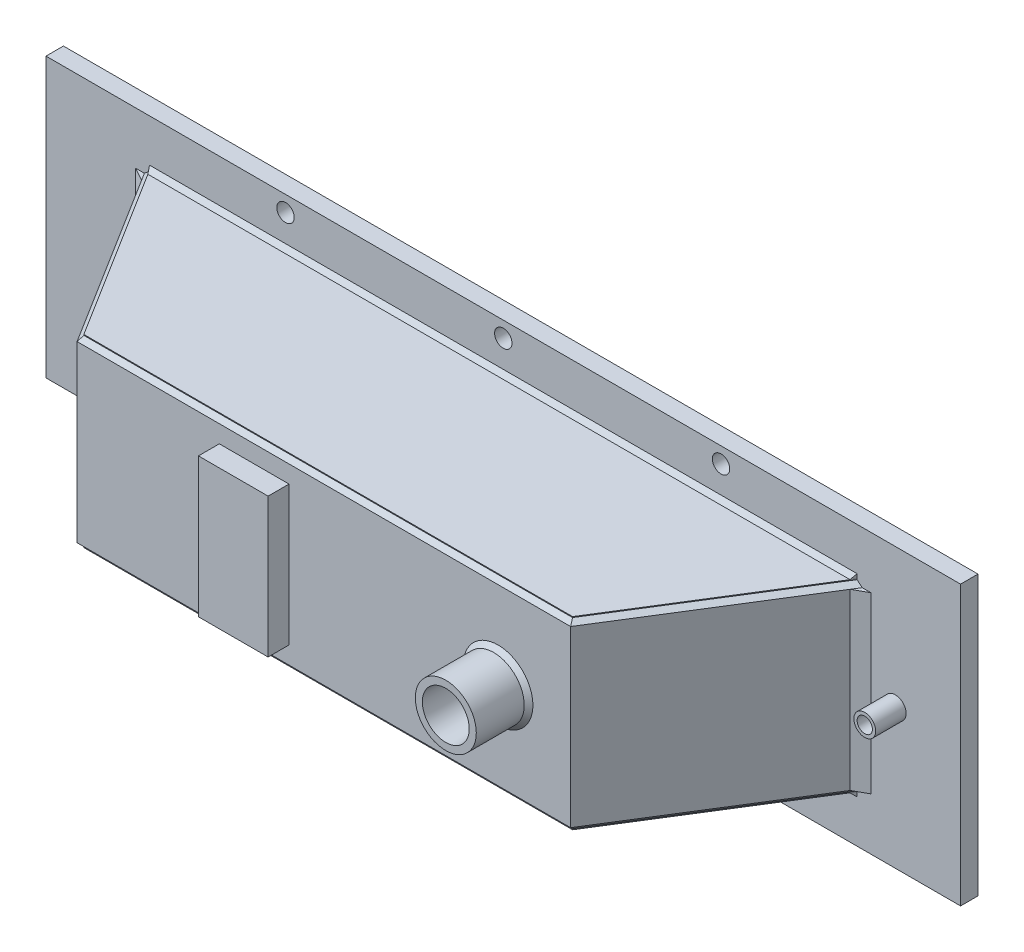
ISO-10303-21;
HEADER;
FILE_DESCRIPTION(('STEP AP214'),'2;1');
FILE_NAME('part.step','',(''),(''),'','','');
FILE_SCHEMA(('AUTOMOTIVE_DESIGN { 1 0 10303 214 1 1 1 1 }'));
ENDSEC;
DATA;
#1=APPLICATION_CONTEXT('core data for automotive mechanical design processes');
#2=APPLICATION_PROTOCOL_DEFINITION('international standard','automotive_design',2000,#1);
#3=PRODUCT_CONTEXT('',#1,'mechanical');
#4=PRODUCT('Part','Part','',(#3));
#5=PRODUCT_RELATED_PRODUCT_CATEGORY('part','',(#4));
#6=PRODUCT_DEFINITION_FORMATION('','',#4);
#7=PRODUCT_DEFINITION_CONTEXT('part definition',#1,'design');
#8=PRODUCT_DEFINITION('design','',#6,#7);
#9=PRODUCT_DEFINITION_SHAPE('','',#8);
#10=(LENGTH_UNIT() NAMED_UNIT(*) SI_UNIT(.MILLI.,.METRE.));
#11=(NAMED_UNIT(*) PLANE_ANGLE_UNIT() SI_UNIT($,.RADIAN.));
#12=(NAMED_UNIT(*) SI_UNIT($,.STERADIAN.) SOLID_ANGLE_UNIT());
#13=UNCERTAINTY_MEASURE_WITH_UNIT(LENGTH_MEASURE(1.E-05),#10,'distance_accuracy_value','');
#14=(GEOMETRIC_REPRESENTATION_CONTEXT(3) GLOBAL_UNCERTAINTY_ASSIGNED_CONTEXT((#13)) GLOBAL_UNIT_ASSIGNED_CONTEXT((#10,
#11,#12)) REPRESENTATION_CONTEXT('',''));
#15=CARTESIAN_POINT('',(0.,0.,0.));
#16=DIRECTION('',(0.,0.,1.));
#17=DIRECTION('',(1.,0.,0.));
#18=AXIS2_PLACEMENT_3D('',#15,#16,#17);
#19=CARTESIAN_POINT('',(437.630136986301,34.4028411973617,23.7225265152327));
#20=DIRECTION('',(0.,0.,1.));
#21=DIRECTION('',(1.,0.,0.));
#22=AXIS2_PLACEMENT_3D('',#19,#20,#21);
#23=CYLINDRICAL_SURFACE('',#22,4.37500000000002);
#24=CARTESIAN_POINT('',(437.630136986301,34.4028411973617,-12.5));
#25=DIRECTION('',(0.,0.,1.));
#26=DIRECTION('',(1.,0.,0.));
#27=AXIS2_PLACEMENT_3D('',#24,#25,#26);
#28=CIRCLE('',#27,4.37500000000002);
#29=CARTESIAN_POINT('',(442.005136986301,34.4028411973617,-12.5));
#30=VERTEX_POINT('',#29);
#31=EDGE_CURVE('E11',#30,#30,#28,.T.);
#32=ORIENTED_EDGE('',*,*,#31,.F.);
#33=EDGE_LOOP('',(#32));
#34=FACE_BOUND('',#33,.T.);
#35=CARTESIAN_POINT('',(437.630136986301,34.4028411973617,27.5));
#36=DIRECTION('',(0.,0.,1.));
#37=DIRECTION('',(1.,0.,0.));
#38=AXIS2_PLACEMENT_3D('',#35,#36,#37);
#39=CIRCLE('',#38,4.37500000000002);
#40=CARTESIAN_POINT('',(442.005136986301,34.4028411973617,27.5));
#41=VERTEX_POINT('',#40);
#42=EDGE_CURVE('E52',#41,#41,#39,.T.);
#43=ORIENTED_EDGE('',*,*,#42,.T.);
#44=EDGE_LOOP('',(#43));
#45=FACE_BOUND('',#44,.T.);
#46=ADVANCED_FACE('F38',(#34,#45),#23,.F.);
#47=CARTESIAN_POINT('',(442.005136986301,34.4028411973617,-12.5));
#48=DIRECTION('',(0.,0.,1.));
#49=DIRECTION('',(1.,0.,0.));
#50=AXIS2_PLACEMENT_3D('',#47,#48,#49);
#51=PLANE('',#50);
#52=CARTESIAN_POINT('',(437.630136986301,34.4028411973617,-12.5));
#53=DIRECTION('',(0.,0.,1.));
#54=DIRECTION('',(1.,0.,0.));
#55=AXIS2_PLACEMENT_3D('',#52,#53,#54);
#56=CIRCLE('',#55,6.24999999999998);
#57=CARTESIAN_POINT('',(443.880136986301,34.4028411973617,-12.5));
#58=VERTEX_POINT('',#57);
#59=EDGE_CURVE('E44',#58,#58,#56,.T.);
#60=ORIENTED_EDGE('',*,*,#59,.F.);
#61=EDGE_LOOP('',(#60));
#62=FACE_BOUND('',#61,.T.);
#63=ORIENTED_EDGE('',*,*,#31,.T.);
#64=EDGE_LOOP('',(#63));
#65=FACE_BOUND('',#64,.T.);
#66=ADVANCED_FACE('F67',(#62,#65),#51,.F.);
#67=CARTESIAN_POINT('',(437.630136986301,34.4028411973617,23.7225265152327));
#68=DIRECTION('',(0.,0.,1.));
#69=DIRECTION('',(1.,0.,0.));
#70=AXIS2_PLACEMENT_3D('',#67,#68,#69);
#71=CYLINDRICAL_SURFACE('',#70,6.24999999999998);
#72=CARTESIAN_POINT('',(437.630136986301,34.4028411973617,27.5));
#73=DIRECTION('',(0.,0.,1.));
#74=DIRECTION('',(1.,0.,0.));
#75=AXIS2_PLACEMENT_3D('',#72,#73,#74);
#76=CIRCLE('',#75,6.24999999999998);
#77=CARTESIAN_POINT('',(443.880136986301,34.4028411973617,27.5));
#78=VERTEX_POINT('',#77);
#79=EDGE_CURVE('E48',#78,#78,#76,.T.);
#80=ORIENTED_EDGE('',*,*,#79,.F.);
#81=EDGE_LOOP('',(#80));
#82=FACE_BOUND('',#81,.T.);
#83=ORIENTED_EDGE('',*,*,#59,.T.);
#84=EDGE_LOOP('',(#83));
#85=FACE_BOUND('',#84,.T.);
#86=ADVANCED_FACE('F62',(#82,#85),#71,.T.);
#87=CARTESIAN_POINT('',(442.005136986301,34.4028411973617,27.5));
#88=DIRECTION('',(0.,0.,-1.));
#89=DIRECTION('',(-1.,0.,0.));
#90=AXIS2_PLACEMENT_3D('',#87,#88,#89);
#91=PLANE('',#90);
#92=ORIENTED_EDGE('',*,*,#42,.F.);
#93=EDGE_LOOP('',(#92));
#94=FACE_BOUND('',#93,.T.);
#95=ORIENTED_EDGE('',*,*,#79,.T.);
#96=EDGE_LOOP('',(#95));
#97=FACE_BOUND('',#96,.T.);
#98=ADVANCED_FACE('F59',(#94,#97),#91,.F.);
#99=CLOSED_SHELL('',(#46,#66,#86,#98));
#100=MANIFOLD_SOLID_BREP('B2',#99);
#101=CARTESIAN_POINT('',(312.6301369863,34.4028411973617,115.5));
#102=DIRECTION('',(0.,0.,-1.));
#103=DIRECTION('',(-1.,0.,0.));
#104=AXIS2_PLACEMENT_3D('',#101,#102,#103);
#105=CONICAL_SURFACE('',#104,17.5,0.785398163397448);
#106=CARTESIAN_POINT('',(312.6301369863,34.4028411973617,113.));
#107=DIRECTION('',(0.,0.,-1.));
#108=DIRECTION('',(-1.,0.,0.));
#109=AXIS2_PLACEMENT_3D('',#106,#107,#108);
#110=CIRCLE('',#109,20.);
#111=CARTESIAN_POINT('',(292.6301369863,34.4028411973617,113.));
#112=VERTEX_POINT('',#111);
#113=EDGE_CURVE('E37',#112,#112,#110,.T.);
#114=ORIENTED_EDGE('',*,*,#113,.F.);
#115=EDGE_LOOP('',(#114));
#116=FACE_BOUND('',#115,.T.);
#117=CARTESIAN_POINT('',(312.6301369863,34.4028411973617,115.5));
#118=DIRECTION('',(0.,0.,-1.));
#119=DIRECTION('',(-1.,0.,0.));
#120=AXIS2_PLACEMENT_3D('',#117,#118,#119);
#121=CIRCLE('',#120,17.5);
#122=CARTESIAN_POINT('',(295.1301369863,34.4028411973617,115.5));
#123=VERTEX_POINT('',#122);
#124=EDGE_CURVE('E114',#123,#123,#121,.F.);
#125=ORIENTED_EDGE('',*,*,#124,.F.);
#126=EDGE_LOOP('',(#125));
#127=FACE_BOUND('',#126,.T.);
#128=ADVANCED_FACE('F108',(#116,#127),#105,.T.);
#129=CARTESIAN_POINT('',(70.9673940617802,-15.5971588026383,113.));
#130=DIRECTION('',(0.,0.,-1.));
#131=DIRECTION('',(-1.,0.,0.));
#132=AXIS2_PLACEMENT_3D('',#129,#130,#131);
#133=PLANE('',#132);
#134=CARTESIAN_POINT('',(312.6301369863,34.4028411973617,113.));
#135=DIRECTION('',(0.,0.,-1.));
#136=DIRECTION('',(-1.,0.,0.));
#137=AXIS2_PLACEMENT_3D('',#134,#135,#136);
#138=CIRCLE('',#137,17.5);
#139=CARTESIAN_POINT('',(295.1301369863,34.4028411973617,113.));
#140=VERTEX_POINT('',#139);
#141=EDGE_CURVE('E118',#140,#140,#138,.F.);
#142=ORIENTED_EDGE('',*,*,#141,.T.);
#143=EDGE_LOOP('',(#142));
#144=FACE_BOUND('',#143,.T.);
#145=ORIENTED_EDGE('',*,*,#113,.T.);
#146=EDGE_LOOP('',(#145));
#147=FACE_BOUND('',#146,.T.);
#148=ADVANCED_FACE('F125',(#144,#147),#133,.T.);
#149=CARTESIAN_POINT('',(312.6301369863,34.4028411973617,134.691345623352));
#150=DIRECTION('',(0.,0.,1.));
#151=DIRECTION('',(1.,0.,0.));
#152=AXIS2_PLACEMENT_3D('',#149,#150,#151);
#153=CYLINDRICAL_SURFACE('',#152,17.5);
#154=ORIENTED_EDGE('',*,*,#141,.F.);
#155=EDGE_LOOP('',(#154));
#156=FACE_BOUND('',#155,.T.);
#157=ORIENTED_EDGE('',*,*,#124,.T.);
#158=EDGE_LOOP('',(#157));
#159=FACE_BOUND('',#158,.T.);
#160=ADVANCED_FACE('F127',(#156,#159),#153,.F.);
#161=CLOSED_SHELL('',(#128,#148,#160));
#162=MANIFOLD_SOLID_BREP('B6',#161);
#163=CARTESIAN_POINT('',(312.6301369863,34.4028411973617,143.));
#164=DIRECTION('',(0.,0.,-1.));
#165=DIRECTION('',(-1.,0.,0.));
#166=AXIS2_PLACEMENT_3D('',#163,#164,#165);
#167=PLANE('',#166);
#168=CARTESIAN_POINT('',(312.6301369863,34.4028411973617,143.));
#169=DIRECTION('',(0.,0.,1.));
#170=DIRECTION('',(1.,0.,0.));
#171=AXIS2_PLACEMENT_3D('',#168,#169,#170);
#172=CIRCLE('',#171,13.4567803);
#173=CARTESIAN_POINT('',(326.0869172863,34.4028411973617,143.));
#174=VERTEX_POINT('',#173);
#175=EDGE_CURVE('E184',#174,#174,#172,.T.);
#176=ORIENTED_EDGE('',*,*,#175,.F.);
#177=EDGE_LOOP('',(#176));
#178=FACE_BOUND('',#177,.T.);
#179=CARTESIAN_POINT('',(312.6301369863,34.4028411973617,143.));
#180=DIRECTION('',(0.,0.,1.));
#181=DIRECTION('',(1.,0.,0.));
#182=AXIS2_PLACEMENT_3D('',#179,#180,#181);
#183=CIRCLE('',#182,17.5);
#184=CARTESIAN_POINT('',(330.1301369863,34.4028411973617,143.));
#185=VERTEX_POINT('',#184);
#186=EDGE_CURVE('E107',#185,#185,#183,.T.);
#187=ORIENTED_EDGE('',*,*,#186,.T.);
#188=EDGE_LOOP('',(#187));
#189=FACE_BOUND('',#188,.T.);
#190=ADVANCED_FACE('F165',(#178,#189),#167,.F.);
#191=CARTESIAN_POINT('',(312.6301369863,34.4028411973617,134.691345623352));
#192=DIRECTION('',(0.,0.,1.));
#193=DIRECTION('',(1.,0.,0.));
#194=AXIS2_PLACEMENT_3D('',#191,#192,#193);
#195=CYLINDRICAL_SURFACE('',#194,17.5);
#196=ORIENTED_EDGE('',*,*,#186,.F.);
#197=EDGE_LOOP('',(#196));
#198=FACE_BOUND('',#197,.T.);
#199=CARTESIAN_POINT('',(312.6301369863,34.4028411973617,113.));
#200=DIRECTION('',(0.,0.,1.));
#201=DIRECTION('',(1.,0.,0.));
#202=AXIS2_PLACEMENT_3D('',#199,#200,#201);
#203=CIRCLE('',#202,17.5);
#204=CARTESIAN_POINT('',(330.1301369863,34.4028411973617,113.));
#205=VERTEX_POINT('',#204);
#206=EDGE_CURVE('E172',#205,#205,#203,.T.);
#207=ORIENTED_EDGE('',*,*,#206,.T.);
#208=EDGE_LOOP('',(#207));
#209=FACE_BOUND('',#208,.T.);
#210=ADVANCED_FACE('F203',(#198,#209),#195,.T.);
#211=CARTESIAN_POINT('',(330.1301369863,34.4028411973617,113.));
#212=DIRECTION('',(0.,0.,1.));
#213=DIRECTION('',(1.,0.,0.));
#214=AXIS2_PLACEMENT_3D('',#211,#212,#213);
#215=PLANE('',#214);
#216=ORIENTED_EDGE('',*,*,#206,.F.);
#217=EDGE_LOOP('',(#216));
#218=FACE_BOUND('',#217,.T.);
#219=CARTESIAN_POINT('',(312.6301369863,34.4028411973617,113.));
#220=DIRECTION('',(0.,0.,1.));
#221=DIRECTION('',(1.,0.,0.));
#222=AXIS2_PLACEMENT_3D('',#219,#220,#221);
#223=CIRCLE('',#222,15.);
#224=CARTESIAN_POINT('',(327.6301369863,34.4028411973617,113.));
#225=VERTEX_POINT('',#224);
#226=EDGE_CURVE('E176',#225,#225,#223,.T.);
#227=ORIENTED_EDGE('',*,*,#226,.T.);
#228=EDGE_LOOP('',(#227));
#229=FACE_BOUND('',#228,.T.);
#230=ADVANCED_FACE('F208',(#218,#229),#215,.F.);
#231=CARTESIAN_POINT('',(312.6301369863,34.4028411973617,134.691345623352));
#232=DIRECTION('',(0.,0.,1.));
#233=DIRECTION('',(1.,0.,0.));
#234=AXIS2_PLACEMENT_3D('',#231,#232,#233);
#235=CYLINDRICAL_SURFACE('',#234,15.);
#236=ORIENTED_EDGE('',*,*,#226,.F.);
#237=EDGE_LOOP('',(#236));
#238=FACE_BOUND('',#237,.T.);
#239=CARTESIAN_POINT('',(312.6301369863,34.4028411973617,110.));
#240=DIRECTION('',(0.,0.,1.));
#241=DIRECTION('',(1.,0.,0.));
#242=AXIS2_PLACEMENT_3D('',#239,#240,#241);
#243=CIRCLE('',#242,15.);
#244=CARTESIAN_POINT('',(327.6301369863,34.4028411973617,110.));
#245=VERTEX_POINT('',#244);
#246=EDGE_CURVE('E181',#245,#245,#243,.T.);
#247=ORIENTED_EDGE('',*,*,#246,.T.);
#248=EDGE_LOOP('',(#247));
#249=FACE_BOUND('',#248,.T.);
#250=ADVANCED_FACE('F200',(#238,#249),#235,.T.);
#251=CARTESIAN_POINT('',(327.6301369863,34.4028411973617,110.));
#252=DIRECTION('',(0.,0.,1.));
#253=DIRECTION('',(1.,0.,0.));
#254=AXIS2_PLACEMENT_3D('',#251,#252,#253);
#255=PLANE('',#254);
#256=CARTESIAN_POINT('',(312.6301369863,34.4028411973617,110.));
#257=DIRECTION('',(0.,0.,1.));
#258=DIRECTION('',(1.,0.,0.));
#259=AXIS2_PLACEMENT_3D('',#256,#257,#258);
#260=CIRCLE('',#259,12.4687161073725);
#261=CARTESIAN_POINT('',(325.098853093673,34.4028411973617,110.));
#262=VERTEX_POINT('',#261);
#263=EDGE_CURVE('E168',#262,#262,#260,.T.);
#264=ORIENTED_EDGE('',*,*,#263,.T.);
#265=EDGE_LOOP('',(#264));
#266=FACE_BOUND('',#265,.T.);
#267=ORIENTED_EDGE('',*,*,#246,.F.);
#268=EDGE_LOOP('',(#267));
#269=FACE_BOUND('',#268,.T.);
#270=ADVANCED_FACE('F191',(#266,#269),#255,.F.);
#271=CARTESIAN_POINT('',(312.6301369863,34.4028411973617,143.));
#272=DIRECTION('',(0.,0.,1.));
#273=DIRECTION('',(1.,0.,0.));
#274=AXIS2_PLACEMENT_3D('',#271,#272,#273);
#275=CONICAL_SURFACE('',#274,13.4567803,0.029932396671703);
#276=ORIENTED_EDGE('',*,*,#175,.T.);
#277=EDGE_LOOP('',(#276));
#278=FACE_BOUND('',#277,.T.);
#279=ORIENTED_EDGE('',*,*,#263,.F.);
#280=EDGE_LOOP('',(#279));
#281=FACE_BOUND('',#280,.T.);
#282=ADVANCED_FACE('F194',(#278,#281),#275,.F.);
#283=CLOSED_SHELL('',(#190,#210,#230,#250,#270,#282));
#284=MANIFOLD_SOLID_BREP('B32',#283);
#285=CARTESIAN_POINT('',(152.6301369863,74.4028411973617,125.));
#286=DIRECTION('',(1.,0.,0.));
#287=DIRECTION('',(0.,1.,0.));
#288=AXIS2_PLACEMENT_3D('',#285,#286,#287);
#289=PLANE('',#288);
#290=DIRECTION('',(0.,-1.,0.));
#291=VECTOR('',#290,1.);
#292=CARTESIAN_POINT('',(152.6301369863,74.4028411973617,113.));
#293=LINE('',#292,#291);
#294=CARTESIAN_POINT('',(152.6301369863,74.4028411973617,113.));
#295=VERTEX_POINT('',#294);
#296=CARTESIAN_POINT('',(152.6301369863,-5.59715880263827,113.));
#297=VERTEX_POINT('',#296);
#298=EDGE_CURVE('E311',#295,#297,#293,.T.);
#299=ORIENTED_EDGE('',*,*,#298,.T.);
#300=DIRECTION('',(0.,0.,-1.));
#301=VECTOR('',#300,1.);
#302=CARTESIAN_POINT('',(152.6301369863,-5.59715880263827,125.));
#303=LINE('',#302,#301);
#304=CARTESIAN_POINT('',(152.6301369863,-5.59715880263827,125.));
#305=VERTEX_POINT('',#304);
#306=EDGE_CURVE('E163',#305,#297,#303,.T.);
#307=ORIENTED_EDGE('',*,*,#306,.F.);
#308=DIRECTION('',(0.,-1.,0.));
#309=VECTOR('',#308,1.);
#310=CARTESIAN_POINT('',(152.6301369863,74.4028411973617,125.));
#311=LINE('',#310,#309);
#312=CARTESIAN_POINT('',(152.6301369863,74.4028411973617,125.));
#313=VERTEX_POINT('',#312);
#314=EDGE_CURVE('E329',#313,#305,#311,.T.);
#315=ORIENTED_EDGE('',*,*,#314,.F.);
#316=DIRECTION('',(0.,0.,-1.));
#317=VECTOR('',#316,1.);
#318=CARTESIAN_POINT('',(152.6301369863,74.4028411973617,125.));
#319=LINE('',#318,#317);
#320=EDGE_CURVE('E323',#313,#295,#319,.T.);
#321=ORIENTED_EDGE('',*,*,#320,.T.);
#322=EDGE_LOOP('',(#299,#307,#315,#321));
#323=FACE_BOUND('',#322,.T.);
#324=ADVANCED_FACE('F267',(#323),#289,.F.);
#325=CARTESIAN_POINT('',(152.6301369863,-5.59715880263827,125.));
#326=DIRECTION('',(0.,1.,0.));
#327=DIRECTION('',(0.,0.,1.));
#328=AXIS2_PLACEMENT_3D('',#325,#326,#327);
#329=PLANE('',#328);
#330=DIRECTION('',(1.,0.,0.));
#331=VECTOR('',#330,1.);
#332=CARTESIAN_POINT('',(152.6301369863,-5.59715880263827,113.));
#333=LINE('',#332,#331);
#334=CARTESIAN_POINT('',(192.6301369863,-5.59715880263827,113.));
#335=VERTEX_POINT('',#334);
#336=EDGE_CURVE('E307',#297,#335,#333,.T.);
#337=ORIENTED_EDGE('',*,*,#336,.T.);
#338=DIRECTION('',(0.,0.,-1.));
#339=VECTOR('',#338,1.);
#340=CARTESIAN_POINT('',(192.6301369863,-5.59715880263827,125.));
#341=LINE('',#340,#339);
#342=CARTESIAN_POINT('',(192.6301369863,-5.59715880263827,125.));
#343=VERTEX_POINT('',#342);
#344=EDGE_CURVE('E274',#343,#335,#341,.T.);
#345=ORIENTED_EDGE('',*,*,#344,.F.);
#346=DIRECTION('',(1.,0.,0.));
#347=VECTOR('',#346,1.);
#348=CARTESIAN_POINT('',(152.6301369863,-5.59715880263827,125.));
#349=LINE('',#348,#347);
#350=EDGE_CURVE('E319',#305,#343,#349,.T.);
#351=ORIENTED_EDGE('',*,*,#350,.F.);
#352=ORIENTED_EDGE('',*,*,#306,.T.);
#353=EDGE_LOOP('',(#337,#345,#351,#352));
#354=FACE_BOUND('',#353,.T.);
#355=ADVANCED_FACE('F318',(#354),#329,.F.);
#356=CARTESIAN_POINT('',(192.6301369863,74.4028411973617,125.));
#357=DIRECTION('',(-1.,0.,0.));
#358=DIRECTION('',(0.,0.,1.));
#359=AXIS2_PLACEMENT_3D('',#356,#357,#358);
#360=PLANE('',#359);
#361=DIRECTION('',(0.,1.,0.));
#362=VECTOR('',#361,1.);
#363=CARTESIAN_POINT('',(192.6301369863,74.4028411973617,113.));
#364=LINE('',#363,#362);
#365=CARTESIAN_POINT('',(192.6301369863,74.4028411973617,113.));
#366=VERTEX_POINT('',#365);
#367=EDGE_CURVE('E312',#335,#366,#364,.T.);
#368=ORIENTED_EDGE('',*,*,#367,.T.);
#369=DIRECTION('',(0.,0.,-1.));
#370=VECTOR('',#369,1.);
#371=CARTESIAN_POINT('',(192.6301369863,74.4028411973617,125.));
#372=LINE('',#371,#370);
#373=CARTESIAN_POINT('',(192.6301369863,74.4028411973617,125.));
#374=VERTEX_POINT('',#373);
#375=EDGE_CURVE('E335',#374,#366,#372,.T.);
#376=ORIENTED_EDGE('',*,*,#375,.F.);
#377=DIRECTION('',(0.,1.,0.));
#378=VECTOR('',#377,1.);
#379=CARTESIAN_POINT('',(192.6301369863,74.4028411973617,125.));
#380=LINE('',#379,#378);
#381=EDGE_CURVE('E286',#343,#374,#380,.T.);
#382=ORIENTED_EDGE('',*,*,#381,.F.);
#383=ORIENTED_EDGE('',*,*,#344,.T.);
#384=EDGE_LOOP('',(#368,#376,#382,#383));
#385=FACE_BOUND('',#384,.T.);
#386=ADVANCED_FACE('F338',(#385),#360,.F.);
#387=CARTESIAN_POINT('',(152.6301369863,74.4028411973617,125.));
#388=DIRECTION('',(0.,-1.,0.));
#389=DIRECTION('',(0.,0.,-1.));
#390=AXIS2_PLACEMENT_3D('',#387,#388,#389);
#391=PLANE('',#390);
#392=DIRECTION('',(-1.,0.,0.));
#393=VECTOR('',#392,1.);
#394=CARTESIAN_POINT('',(152.6301369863,74.4028411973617,113.));
#395=LINE('',#394,#393);
#396=EDGE_CURVE('E327',#366,#295,#395,.T.);
#397=ORIENTED_EDGE('',*,*,#396,.T.);
#398=ORIENTED_EDGE('',*,*,#320,.F.);
#399=DIRECTION('',(-1.,0.,0.));
#400=VECTOR('',#399,1.);
#401=CARTESIAN_POINT('',(152.6301369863,74.4028411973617,125.));
#402=LINE('',#401,#400);
#403=EDGE_CURVE('E281',#374,#313,#402,.T.);
#404=ORIENTED_EDGE('',*,*,#403,.F.);
#405=ORIENTED_EDGE('',*,*,#375,.T.);
#406=EDGE_LOOP('',(#397,#398,#404,#405));
#407=FACE_BOUND('',#406,.T.);
#408=ADVANCED_FACE('F340',(#407),#391,.F.);
#409=CARTESIAN_POINT('',(152.6301369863,-5.59715880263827,125.));
#410=DIRECTION('',(0.,0.,1.));
#411=DIRECTION('',(1.,0.,0.));
#412=AXIS2_PLACEMENT_3D('',#409,#410,#411);
#413=PLANE('',#412);
#414=ORIENTED_EDGE('',*,*,#314,.T.);
#415=ORIENTED_EDGE('',*,*,#350,.T.);
#416=ORIENTED_EDGE('',*,*,#381,.T.);
#417=ORIENTED_EDGE('',*,*,#403,.T.);
#418=EDGE_LOOP('',(#414,#415,#416,#417));
#419=FACE_BOUND('',#418,.T.);
#420=ADVANCED_FACE('F341',(#419),#413,.T.);
#421=CARTESIAN_POINT('',(152.6301369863,-5.59715880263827,113.));
#422=DIRECTION('',(0.,0.,1.));
#423=DIRECTION('',(1.,0.,0.));
#424=AXIS2_PLACEMENT_3D('',#421,#422,#423);
#425=PLANE('',#424);
#426=ORIENTED_EDGE('',*,*,#298,.F.);
#427=ORIENTED_EDGE('',*,*,#396,.F.);
#428=ORIENTED_EDGE('',*,*,#367,.F.);
#429=ORIENTED_EDGE('',*,*,#336,.F.);
#430=EDGE_LOOP('',(#426,#427,#428,#429));
#431=FACE_BOUND('',#430,.T.);
#432=ADVANCED_FACE('F308',(#431),#425,.F.);
#433=CLOSED_SHELL('',(#324,#355,#386,#408,#420,#432));
#434=MANIFOLD_SOLID_BREP('B102',#433);
#435=CARTESIAN_POINT('',(352.907260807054,-18.5971588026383,110.5));
#436=DIRECTION('',(-0.847998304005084,0.,-0.529998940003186));
#437=DIRECTION('',(-0.529998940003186,0.,0.847998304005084));
#438=AXIS2_PLACEMENT_3D('',#435,#436,#437);
#439=PLANE('',#438);
#440=DIRECTION('',(0.,1.,0.));
#441=VECTOR('',#440,1.);
#442=CARTESIAN_POINT('',(415.719760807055,-18.5971588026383,9.99999999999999));
#443=LINE('',#442,#441);
#444=CARTESIAN_POINT('',(415.719760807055,-21.0971588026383,10.));
#445=VERTEX_POINT('',#444);
#446=CARTESIAN_POINT('',(415.719760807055,-18.5971588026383,10.));
#447=VERTEX_POINT('',#446);
#448=EDGE_CURVE('E423',#445,#447,#443,.T.);
#449=ORIENTED_EDGE('',*,*,#448,.T.);
#450=DIRECTION('',(-0.529998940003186,0.,0.847998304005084));
#451=VECTOR('',#450,1.);
#452=CARTESIAN_POINT('',(352.907260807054,-18.5971588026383,110.5));
#453=LINE('',#452,#451);
#454=CARTESIAN_POINT('',(414.157260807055,-18.5971588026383,12.5));
#455=VERTEX_POINT('',#454);
#456=EDGE_CURVE('E446',#447,#455,#453,.T.);
#457=ORIENTED_EDGE('',*,*,#456,.T.);
#458=DIRECTION('',(-0.404226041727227,0.646761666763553,0.646761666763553));
#459=VECTOR('',#458,1.);
#460=CARTESIAN_POINT('',(378.528175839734,38.4093771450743,69.5065359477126));
#461=LINE('',#460,#459);
#462=EDGE_CURVE('E409',#455,#445,#461,.F.);
#463=ORIENTED_EDGE('',*,*,#462,.T.);
#464=EDGE_LOOP('',(#449,#457,#463));
#465=FACE_BOUND('',#464,.T.);
#466=ADVANCED_FACE('F401',(#465),#439,.F.);
#467=CARTESIAN_POINT('',(9.70613783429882,-18.5971588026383,10.2649994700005));
#468=DIRECTION('',(0.847998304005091,0.,-0.529998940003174));
#469=DIRECTION('',(-0.529998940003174,0.,-0.847998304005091));
#470=AXIS2_PLACEMENT_3D('',#467,#468,#469);
#471=PLANE('',#470);
#472=DIRECTION('',(-0.404226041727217,-0.646761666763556,-0.646761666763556));
#473=VECTOR('',#472,1.);
#474=CARTESIAN_POINT('',(10.290451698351,-19.8972571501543,11.1999016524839));
#475=LINE('',#474,#473);
#476=CARTESIAN_POINT('',(9.54051316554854,-21.0971588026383,10.));
#477=VERTEX_POINT('',#476);
#478=CARTESIAN_POINT('',(11.1030131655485,-18.5971588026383,12.5));
#479=VERTEX_POINT('',#478);
#480=EDGE_CURVE('E265',#477,#479,#475,.F.);
#481=ORIENTED_EDGE('',*,*,#480,.T.);
#482=DIRECTION('',(-0.529998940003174,0.,-0.847998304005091));
#483=VECTOR('',#482,1.);
#484=CARTESIAN_POINT('',(9.70613783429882,-18.5971588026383,10.2649994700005));
#485=LINE('',#484,#483);
#486=CARTESIAN_POINT('',(9.54051316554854,-18.5971588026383,10.));
#487=VERTEX_POINT('',#486);
#488=EDGE_CURVE('E416',#479,#487,#485,.T.);
#489=ORIENTED_EDGE('',*,*,#488,.T.);
#490=DIRECTION('',(0.,1.,0.));
#491=VECTOR('',#490,1.);
#492=CARTESIAN_POINT('',(9.54051316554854,-45.5971588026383,10.));
#493=LINE('',#492,#491);
#494=EDGE_CURVE('E434',#477,#487,#493,.T.);
#495=ORIENTED_EDGE('',*,*,#494,.F.);
#496=EDGE_LOOP('',(#481,#489,#495));
#497=FACE_BOUND('',#496,.T.);
#498=ADVANCED_FACE('F403',(#497),#471,.F.);
#499=CARTESIAN_POINT('',(9.54051316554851,-18.5971588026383,12.5));
#500=DIRECTION('',(0.,-0.707106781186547,0.707106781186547));
#501=DIRECTION('',(0.,-0.707106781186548,-0.707106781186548));
#502=AXIS2_PLACEMENT_3D('',#499,#500,#501);
#503=PLANE('',#502);
#504=ORIENTED_EDGE('',*,*,#480,.F.);
#505=DIRECTION('',(-1.,0.,0.));
#506=VECTOR('',#505,1.);
#507=CARTESIAN_POINT('',(9.54051316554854,-21.0971588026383,10.));
#508=LINE('',#507,#506);
#509=EDGE_CURVE('E439',#445,#477,#508,.T.);
#510=ORIENTED_EDGE('',*,*,#509,.F.);
#511=ORIENTED_EDGE('',*,*,#462,.F.);
#512=DIRECTION('',(1.,0.,0.));
#513=VECTOR('',#512,1.);
#514=CARTESIAN_POINT('',(415.719760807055,-18.5971588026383,12.5));
#515=LINE('',#514,#513);
#516=EDGE_CURVE('E442',#479,#455,#515,.T.);
#517=ORIENTED_EDGE('',*,*,#516,.F.);
#518=EDGE_LOOP('',(#504,#510,#511,#517));
#519=FACE_BOUND('',#518,.T.);
#520=ADVANCED_FACE('F457',(#519),#503,.T.);
#521=CARTESIAN_POINT('',(-49.8698630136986,-45.5971588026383,10.));
#522=DIRECTION('',(0.,0.,1.));
#523=DIRECTION('',(1.,0.,0.));
#524=AXIS2_PLACEMENT_3D('',#521,#522,#523);
#525=PLANE('',#524);
#526=ORIENTED_EDGE('',*,*,#509,.T.);
#527=ORIENTED_EDGE('',*,*,#494,.T.);
#528=DIRECTION('',(1.,0.,0.));
#529=VECTOR('',#528,1.);
#530=CARTESIAN_POINT('',(-49.8698630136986,-18.5971588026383,10.));
#531=LINE('',#530,#529);
#532=EDGE_CURVE('E436',#487,#447,#531,.T.);
#533=ORIENTED_EDGE('',*,*,#532,.T.);
#534=ORIENTED_EDGE('',*,*,#448,.F.);
#535=EDGE_LOOP('',(#526,#527,#533,#534));
#536=FACE_BOUND('',#535,.T.);
#537=ADVANCED_FACE('F435',(#536),#525,.F.);
#538=CARTESIAN_POINT('',(9.54051316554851,-18.5971588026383,9.99999999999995));
#539=DIRECTION('',(0.,-1.,0.));
#540=DIRECTION('',(0.,0.,-1.));
#541=AXIS2_PLACEMENT_3D('',#538,#539,#540);
#542=PLANE('',#541);
#543=ORIENTED_EDGE('',*,*,#456,.F.);
#544=ORIENTED_EDGE('',*,*,#532,.F.);
#545=ORIENTED_EDGE('',*,*,#488,.F.);
#546=ORIENTED_EDGE('',*,*,#516,.T.);
#547=EDGE_LOOP('',(#543,#544,#545,#546));
#548=FACE_BOUND('',#547,.T.);
#549=ADVANCED_FACE('F444',(#548),#542,.F.);
#550=CLOSED_SHELL('',(#466,#498,#520,#537,#549));
#551=MANIFOLD_SOLID_BREP('B157',#550);
#552=CARTESIAN_POINT('',(9.70613783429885,87.4028411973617,10.2649994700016));
#553=DIRECTION('',(0.847998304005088,0.,-0.52999894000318));
#554=DIRECTION('',(-0.52999894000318,0.,-0.847998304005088));
#555=AXIS2_PLACEMENT_3D('',#552,#553,#554);
#556=PLANE('',#555);
#557=DIRECTION('',(0.52999894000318,0.,0.847998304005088));
#558=VECTOR('',#557,1.);
#559=CARTESIAN_POINT('',(212.630136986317,87.4028411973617,334.94339811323));
#560=LINE('',#559,#558);
#561=CARTESIAN_POINT('',(9.54051316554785,87.4028411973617,10.));
#562=VERTEX_POINT('',#561);
#563=CARTESIAN_POINT('',(11.1030131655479,87.4028411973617,12.5));
#564=VERTEX_POINT('',#563);
#565=EDGE_CURVE('E548',#562,#564,#560,.T.);
#566=ORIENTED_EDGE('',*,*,#565,.T.);
#567=DIRECTION('',(-0.404226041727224,0.646761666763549,-0.646761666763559));
#568=VECTOR('',#567,1.);
#569=CARTESIAN_POINT('',(10.2904516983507,88.7029395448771,11.1999016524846));
#570=LINE('',#569,#568);
#571=CARTESIAN_POINT('',(9.54051316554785,89.9028411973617,10.));
#572=VERTEX_POINT('',#571);
#573=EDGE_CURVE('E399',#564,#572,#570,.T.);
#574=ORIENTED_EDGE('',*,*,#573,.T.);
#575=DIRECTION('',(0.,-1.,0.));
#576=VECTOR('',#575,1.);
#577=CARTESIAN_POINT('',(9.54051316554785,87.4028411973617,10.));
#578=LINE('',#577,#576);
#579=EDGE_CURVE('E532',#572,#562,#578,.T.);
#580=ORIENTED_EDGE('',*,*,#579,.T.);
#581=EDGE_LOOP('',(#566,#574,#580));
#582=FACE_BOUND('',#581,.T.);
#583=ADVANCED_FACE('F509',(#582),#556,.F.);
#584=CARTESIAN_POINT('',(415.554136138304,87.4028411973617,10.2649994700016));
#585=DIRECTION('',(-0.847998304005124,0.,-0.529998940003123));
#586=DIRECTION('',(-0.529998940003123,0.,0.847998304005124));
#587=AXIS2_PLACEMENT_3D('',#584,#585,#586);
#588=PLANE('',#587);
#589=DIRECTION('',(0.529998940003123,0.,-0.847998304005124));
#590=VECTOR('',#589,1.);
#591=CARTESIAN_POINT('',(212.630136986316,87.4028411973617,334.94339811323));
#592=LINE('',#591,#590);
#593=CARTESIAN_POINT('',(414.157260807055,87.4028411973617,12.5));
#594=VERTEX_POINT('',#593);
#595=CARTESIAN_POINT('',(415.719760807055,87.4028411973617,10.));
#596=VERTEX_POINT('',#595);
#597=EDGE_CURVE('E524',#594,#596,#592,.T.);
#598=ORIENTED_EDGE('',*,*,#597,.T.);
#599=DIRECTION('',(0.,-1.,0.));
#600=VECTOR('',#599,1.);
#601=CARTESIAN_POINT('',(415.719760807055,-45.5971588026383,10.));
#602=LINE('',#601,#600);
#603=CARTESIAN_POINT('',(415.719760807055,89.9028411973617,10.));
#604=VERTEX_POINT('',#603);
#605=EDGE_CURVE('E545',#604,#596,#602,.T.);
#606=ORIENTED_EDGE('',*,*,#605,.F.);
#607=DIRECTION('',(-0.404226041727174,-0.646761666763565,0.646761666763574));
#608=VECTOR('',#607,1.);
#609=CARTESIAN_POINT('',(414.969822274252,88.7029395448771,11.1999016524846));
#610=LINE('',#609,#608);
#611=EDGE_CURVE('E517',#604,#594,#610,.T.);
#612=ORIENTED_EDGE('',*,*,#611,.T.);
#613=EDGE_LOOP('',(#598,#606,#612));
#614=FACE_BOUND('',#613,.T.);
#615=ADVANCED_FACE('F511',(#614),#588,.F.);
#616=CARTESIAN_POINT('',(-49.8698630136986,89.9028411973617,10.));
#617=DIRECTION('',(0.,-0.707106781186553,-0.707106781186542));
#618=DIRECTION('',(0.,0.707106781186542,-0.707106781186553));
#619=AXIS2_PLACEMENT_3D('',#616,#617,#618);
#620=PLANE('',#619);
#621=ORIENTED_EDGE('',*,*,#573,.F.);
#622=DIRECTION('',(-1.,0.,0.));
#623=VECTOR('',#622,1.);
#624=CARTESIAN_POINT('',(212.630136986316,87.4028411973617,12.5));
#625=LINE('',#624,#623);
#626=EDGE_CURVE('E551',#594,#564,#625,.T.);
#627=ORIENTED_EDGE('',*,*,#626,.F.);
#628=ORIENTED_EDGE('',*,*,#611,.F.);
#629=DIRECTION('',(1.,0.,0.));
#630=VECTOR('',#629,1.);
#631=CARTESIAN_POINT('',(-49.8698630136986,89.9028411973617,10.));
#632=LINE('',#631,#630);
#633=EDGE_CURVE('E557',#572,#604,#632,.T.);
#634=ORIENTED_EDGE('',*,*,#633,.F.);
#635=EDGE_LOOP('',(#621,#627,#628,#634));
#636=FACE_BOUND('',#635,.T.);
#637=ADVANCED_FACE('F565',(#636),#620,.F.);
#638=CARTESIAN_POINT('',(-49.8698630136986,-45.5971588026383,10.));
#639=DIRECTION('',(0.,0.,1.));
#640=DIRECTION('',(1.,0.,0.));
#641=AXIS2_PLACEMENT_3D('',#638,#639,#640);
#642=PLANE('',#641);
#643=ORIENTED_EDGE('',*,*,#633,.T.);
#644=ORIENTED_EDGE('',*,*,#605,.T.);
#645=DIRECTION('',(1.,0.,0.));
#646=VECTOR('',#645,1.);
#647=CARTESIAN_POINT('',(-49.8698630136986,87.4028411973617,10.));
#648=LINE('',#647,#646);
#649=EDGE_CURVE('E541',#562,#596,#648,.T.);
#650=ORIENTED_EDGE('',*,*,#649,.F.);
#651=ORIENTED_EDGE('',*,*,#579,.F.);
#652=EDGE_LOOP('',(#643,#644,#650,#651));
#653=FACE_BOUND('',#652,.T.);
#654=ADVANCED_FACE('F543',(#653),#642,.F.);
#655=CARTESIAN_POINT('',(212.630136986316,87.4028411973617,334.94339811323));
#656=DIRECTION('',(0.,-1.,0.));
#657=DIRECTION('',(0.,0.,-1.));
#658=AXIS2_PLACEMENT_3D('',#655,#656,#657);
#659=PLANE('',#658);
#660=ORIENTED_EDGE('',*,*,#626,.T.);
#661=ORIENTED_EDGE('',*,*,#565,.F.);
#662=ORIENTED_EDGE('',*,*,#649,.T.);
#663=ORIENTED_EDGE('',*,*,#597,.F.);
#664=EDGE_LOOP('',(#660,#661,#662,#663));
#665=FACE_BOUND('',#664,.T.);
#666=ADVANCED_FACE('F549',(#665),#659,.T.);
#667=CLOSED_SHELL('',(#583,#615,#637,#654,#666));
#668=MANIFOLD_SOLID_BREP('B259',#667);
#669=CARTESIAN_POINT('',(10.1301369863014,-15.5971588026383,10.));
#670=DIRECTION('',(0.,0.,1.));
#671=DIRECTION('',(1.,0.,0.));
#672=AXIS2_PLACEMENT_3D('',#669,#670,#671);
#673=PLANE('',#672);
#674=DIRECTION('',(1.,0.,0.));
#675=VECTOR('',#674,1.);
#676=CARTESIAN_POINT('',(10.1301369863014,84.4028411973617,10.));
#677=LINE('',#676,#675);
#678=CARTESIAN_POINT('',(6.59239406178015,84.4028411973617,10.));
#679=VERTEX_POINT('',#678);
#680=CARTESIAN_POINT('',(9.54051316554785,84.4028411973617,10.));
#681=VERTEX_POINT('',#680);
#682=EDGE_CURVE('E700',#679,#681,#677,.T.);
#683=ORIENTED_EDGE('',*,*,#682,.F.);
#684=DIRECTION('',(-0.762692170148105,-0.646761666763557,0.));
#685=VECTOR('',#684,1.);
#686=CARTESIAN_POINT('',(-40.6777091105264,44.3178738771,10.));
#687=LINE('',#686,#685);
#688=CARTESIAN_POINT('',(9.54051316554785,86.9028411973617,10.));
#689=VERTEX_POINT('',#688);
#690=EDGE_CURVE('E507',#679,#689,#687,.F.);
#691=ORIENTED_EDGE('',*,*,#690,.T.);
#692=DIRECTION('',(0.,-1.,0.));
#693=VECTOR('',#692,1.);
#694=CARTESIAN_POINT('',(9.54051316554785,87.4028411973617,10.));
#695=LINE('',#694,#693);
#696=EDGE_CURVE('E639',#689,#681,#695,.T.);
#697=ORIENTED_EDGE('',*,*,#696,.T.);
#698=EDGE_LOOP('',(#683,#691,#697));
#699=FACE_BOUND('',#698,.T.);
#700=ADVANCED_FACE('F617',(#699),#673,.F.);
#701=DIRECTION('',(1.,0.,0.));
#702=VECTOR('',#701,1.);
#703=CARTESIAN_POINT('',(415.130136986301,84.4028411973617,10.));
#704=LINE('',#703,#702);
#705=CARTESIAN_POINT('',(415.719760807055,84.4028411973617,10.));
#706=VERTEX_POINT('',#705);
#707=CARTESIAN_POINT('',(418.667879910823,84.4028411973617,10.));
#708=VERTEX_POINT('',#707);
#709=EDGE_CURVE('E669',#706,#708,#704,.T.);
#710=ORIENTED_EDGE('',*,*,#709,.F.);
#711=DIRECTION('',(0.,-1.,0.));
#712=VECTOR('',#711,1.);
#713=CARTESIAN_POINT('',(415.719760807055,-15.5971588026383,10.));
#714=LINE('',#713,#712);
#715=CARTESIAN_POINT('',(415.719760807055,86.9028411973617,10.));
#716=VERTEX_POINT('',#715);
#717=EDGE_CURVE('E684',#716,#706,#714,.T.);
#718=ORIENTED_EDGE('',*,*,#717,.F.);
#719=DIRECTION('',(-0.762692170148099,0.646761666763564,0.));
#720=VECTOR('',#719,1.);
#721=CARTESIAN_POINT('',(230.349747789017,244.096297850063,10.));
#722=LINE('',#721,#720);
#723=EDGE_CURVE('E624',#716,#708,#722,.F.);
#724=ORIENTED_EDGE('',*,*,#723,.T.);
#725=EDGE_LOOP('',(#710,#718,#724));
#726=FACE_BOUND('',#725,.T.);
#727=ADVANCED_FACE('F683',(#726),#673,.F.);
#728=CARTESIAN_POINT('',(9.70613783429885,86.9028411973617,10.2649994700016));
#729=DIRECTION('',(-0.599625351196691,0.707106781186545,0.374765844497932));
#730=DIRECTION('',(-0.762692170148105,-0.646761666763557,0.));
#731=AXIS2_PLACEMENT_3D('',#728,#729,#730);
#732=PLANE('',#731);
#733=ORIENTED_EDGE('',*,*,#690,.F.);
#734=DIRECTION('',(-0.529998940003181,0.,-0.847998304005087));
#735=VECTOR('',#734,1.);
#736=CARTESIAN_POINT('',(7.58614207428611,84.4028411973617,11.5899968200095));
#737=LINE('',#736,#735);
#738=CARTESIAN_POINT('',(70.9673940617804,84.4028411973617,113.));
#739=VERTEX_POINT('',#738);
#740=EDGE_CURVE('E694',#739,#679,#737,.T.);
#741=ORIENTED_EDGE('',*,*,#740,.F.);
#742=DIRECTION('',(0.364890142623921,0.658352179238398,-0.658352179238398));
#743=VECTOR('',#742,1.);
#744=CARTESIAN_POINT('',(88.0909818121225,115.298034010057,82.104807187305));
#745=LINE('',#744,#743);
#746=CARTESIAN_POINT('',(72.3530131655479,86.9028411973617,110.5));
#747=VERTEX_POINT('',#746);
#748=EDGE_CURVE('E708',#747,#739,#745,.F.);
#749=ORIENTED_EDGE('',*,*,#748,.F.);
#750=DIRECTION('',(0.52999894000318,0.,0.847998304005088));
#751=VECTOR('',#750,1.);
#752=CARTESIAN_POINT('',(72.3530131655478,86.9028411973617,110.5));
#753=LINE('',#752,#751);
#754=EDGE_CURVE('E687',#689,#747,#753,.T.);
#755=ORIENTED_EDGE('',*,*,#754,.F.);
#756=EDGE_LOOP('',(#733,#741,#749,#755));
#757=FACE_BOUND('',#756,.T.);
#758=ADVANCED_FACE('F726',(#757),#732,.T.);
#759=CARTESIAN_POINT('',(72.3530131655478,86.9028411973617,110.5));
#760=DIRECTION('',(0.,0.707106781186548,0.707106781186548));
#761=DIRECTION('',(0.,-0.707106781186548,0.707106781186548));
#762=AXIS2_PLACEMENT_3D('',#759,#760,#761);
#763=PLANE('',#762);
#764=ORIENTED_EDGE('',*,*,#748,.T.);
#765=DIRECTION('',(-1.,0.,0.));
#766=VECTOR('',#765,1.);
#767=CARTESIAN_POINT('',(70.9673940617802,84.4028411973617,113.));
#768=LINE('',#767,#766);
#769=CARTESIAN_POINT('',(354.292879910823,84.4028411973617,113.));
#770=VERTEX_POINT('',#769);
#771=EDGE_CURVE('E692',#770,#739,#768,.T.);
#772=ORIENTED_EDGE('',*,*,#771,.F.);
#773=DIRECTION('',(-0.364890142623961,0.658352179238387,-0.658352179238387));
#774=VECTOR('',#773,1.);
#775=CARTESIAN_POINT('',(315.552917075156,154.299327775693,43.1035134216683));
#776=LINE('',#775,#774);
#777=CARTESIAN_POINT('',(352.907260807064,86.9028411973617,110.5));
#778=VERTEX_POINT('',#777);
#779=EDGE_CURVE('E691',#778,#770,#776,.F.);
#780=ORIENTED_EDGE('',*,*,#779,.F.);
#781=DIRECTION('',(1.,0.,0.));
#782=VECTOR('',#781,1.);
#783=CARTESIAN_POINT('',(352.907260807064,86.9028411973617,110.5));
#784=LINE('',#783,#782);
#785=EDGE_CURVE('E713',#747,#778,#784,.T.);
#786=ORIENTED_EDGE('',*,*,#785,.F.);
#787=EDGE_LOOP('',(#764,#772,#780,#786));
#788=FACE_BOUND('',#787,.T.);
#789=ADVANCED_FACE('F728',(#788),#763,.T.);
#790=CARTESIAN_POINT('',(415.554136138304,86.9028411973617,10.2649994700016));
#791=DIRECTION('',(0.599625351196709,0.707106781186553,0.374765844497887));
#792=DIRECTION('',(-0.762692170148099,0.646761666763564,0.));
#793=AXIS2_PLACEMENT_3D('',#790,#791,#792);
#794=PLANE('',#793);
#795=ORIENTED_EDGE('',*,*,#779,.T.);
#796=DIRECTION('',(-0.52999894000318,0.,0.847998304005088));
#797=VECTOR('',#796,1.);
#798=CARTESIAN_POINT('',(354.292879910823,84.4028411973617,113.));
#799=LINE('',#798,#797);
#800=EDGE_CURVE('E674',#708,#770,#799,.T.);
#801=ORIENTED_EDGE('',*,*,#800,.F.);
#802=ORIENTED_EDGE('',*,*,#723,.F.);
#803=DIRECTION('',(0.529998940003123,0.,-0.847998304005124));
#804=VECTOR('',#803,1.);
#805=CARTESIAN_POINT('',(415.719760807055,86.9028411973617,10.));
#806=LINE('',#805,#804);
#807=EDGE_CURVE('E711',#778,#716,#806,.T.);
#808=ORIENTED_EDGE('',*,*,#807,.F.);
#809=EDGE_LOOP('',(#795,#801,#802,#808));
#810=FACE_BOUND('',#809,.T.);
#811=ADVANCED_FACE('F689',(#810),#794,.T.);
#812=CARTESIAN_POINT('',(9.70613783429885,87.4028411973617,10.2649994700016));
#813=DIRECTION('',(0.847998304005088,0.,-0.52999894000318));
#814=DIRECTION('',(-0.52999894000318,0.,-0.847998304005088));
#815=AXIS2_PLACEMENT_3D('',#812,#813,#814);
#816=PLANE('',#815);
#817=ORIENTED_EDGE('',*,*,#754,.T.);
#818=DIRECTION('',(0.,-1.,0.));
#819=VECTOR('',#818,1.);
#820=CARTESIAN_POINT('',(72.3530131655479,87.4028411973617,110.5));
#821=LINE('',#820,#819);
#822=CARTESIAN_POINT('',(72.3530131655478,84.4028411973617,110.5));
#823=VERTEX_POINT('',#822);
#824=EDGE_CURVE('E680',#747,#823,#821,.T.);
#825=ORIENTED_EDGE('',*,*,#824,.T.);
#826=DIRECTION('',(0.52999894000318,0.,0.847998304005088));
#827=VECTOR('',#826,1.);
#828=CARTESIAN_POINT('',(213.975009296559,84.4028411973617,337.095193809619));
#829=LINE('',#828,#827);
#830=EDGE_CURVE('E702',#681,#823,#829,.T.);
#831=ORIENTED_EDGE('',*,*,#830,.F.);
#832=ORIENTED_EDGE('',*,*,#696,.F.);
#833=EDGE_LOOP('',(#817,#825,#831,#832));
#834=FACE_BOUND('',#833,.T.);
#835=ADVANCED_FACE('F717',(#834),#816,.T.);
#836=CARTESIAN_POINT('',(72.3530131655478,87.4028411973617,110.5));
#837=DIRECTION('',(0.,0.,-1.));
#838=DIRECTION('',(-1.,0.,0.));
#839=AXIS2_PLACEMENT_3D('',#836,#837,#838);
#840=PLANE('',#839);
#841=ORIENTED_EDGE('',*,*,#785,.T.);
#842=DIRECTION('',(0.,-1.,0.));
#843=VECTOR('',#842,1.);
#844=CARTESIAN_POINT('',(352.907260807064,87.4028411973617,110.5));
#845=LINE('',#844,#843);
#846=CARTESIAN_POINT('',(352.907260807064,84.4028411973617,110.5));
#847=VERTEX_POINT('',#846);
#848=EDGE_CURVE('E631',#778,#847,#845,.T.);
#849=ORIENTED_EDGE('',*,*,#848,.T.);
#850=DIRECTION('',(1.,0.,0.));
#851=VECTOR('',#850,1.);
#852=CARTESIAN_POINT('',(214.399008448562,84.4028411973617,110.5));
#853=LINE('',#852,#851);
#854=EDGE_CURVE('E699',#823,#847,#853,.T.);
#855=ORIENTED_EDGE('',*,*,#854,.F.);
#856=ORIENTED_EDGE('',*,*,#824,.F.);
#857=EDGE_LOOP('',(#841,#849,#855,#856));
#858=FACE_BOUND('',#857,.T.);
#859=ADVANCED_FACE('F723',(#858),#840,.T.);
#860=CARTESIAN_POINT('',(415.554136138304,87.4028411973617,10.2649994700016));
#861=DIRECTION('',(-0.847998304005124,0.,-0.529998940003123));
#862=DIRECTION('',(-0.529998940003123,0.,0.847998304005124));
#863=AXIS2_PLACEMENT_3D('',#860,#861,#862);
#864=PLANE('',#863);
#865=ORIENTED_EDGE('',*,*,#807,.T.);
#866=ORIENTED_EDGE('',*,*,#717,.T.);
#867=DIRECTION('',(0.529998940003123,0.,-0.847998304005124));
#868=VECTOR('',#867,1.);
#869=CARTESIAN_POINT('',(212.279012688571,84.4028411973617,335.505196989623));
#870=LINE('',#869,#868);
#871=EDGE_CURVE('E677',#847,#706,#870,.T.);
#872=ORIENTED_EDGE('',*,*,#871,.F.);
#873=ORIENTED_EDGE('',*,*,#848,.F.);
#874=EDGE_LOOP('',(#865,#866,#872,#873));
#875=FACE_BOUND('',#874,.T.);
#876=ADVANCED_FACE('F729',(#875),#864,.T.);
#877=CARTESIAN_POINT('',(214.399008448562,84.4028411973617,336.830194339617));
#878=DIRECTION('',(0.,-1.,0.));
#879=DIRECTION('',(0.,0.,-1.));
#880=AXIS2_PLACEMENT_3D('',#877,#878,#879);
#881=PLANE('',#880);
#882=ORIENTED_EDGE('',*,*,#830,.T.);
#883=ORIENTED_EDGE('',*,*,#854,.T.);
#884=ORIENTED_EDGE('',*,*,#871,.T.);
#885=ORIENTED_EDGE('',*,*,#709,.T.);
#886=ORIENTED_EDGE('',*,*,#800,.T.);
#887=ORIENTED_EDGE('',*,*,#771,.T.);
#888=ORIENTED_EDGE('',*,*,#740,.T.);
#889=ORIENTED_EDGE('',*,*,#682,.T.);
#890=EDGE_LOOP('',(#882,#883,#884,#885,#886,#887,#888,#889));
#891=FACE_BOUND('',#890,.T.);
#892=ADVANCED_FACE('F672',(#891),#881,.T.);
#893=CLOSED_SHELL('',(#700,#727,#758,#789,#811,#835,#859,#876,#892));
#894=MANIFOLD_SOLID_BREP('B393',#893);
#895=CARTESIAN_POINT('',(10.1301369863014,-15.5971588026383,10.));
#896=DIRECTION('',(0.,0.,1.));
#897=DIRECTION('',(1.,0.,0.));
#898=AXIS2_PLACEMENT_3D('',#895,#896,#897);
#899=PLANE('',#898);
#900=DIRECTION('',(0.,1.,0.));
#901=VECTOR('',#900,1.);
#902=CARTESIAN_POINT('',(415.719760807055,-18.5971588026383,10.));
#903=LINE('',#902,#901);
#904=CARTESIAN_POINT('',(415.719760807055,-18.0971588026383,10.));
#905=VERTEX_POINT('',#904);
#906=CARTESIAN_POINT('',(415.719760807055,-15.5971588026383,10.));
#907=VERTEX_POINT('',#906);
#908=EDGE_CURVE('E845',#905,#907,#903,.T.);
#909=ORIENTED_EDGE('',*,*,#908,.T.);
#910=DIRECTION('',(1.,0.,0.));
#911=VECTOR('',#910,1.);
#912=CARTESIAN_POINT('',(415.130136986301,-15.5971588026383,10.));
#913=LINE('',#912,#911);
#914=CARTESIAN_POINT('',(418.667879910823,-15.5971588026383,10.));
#915=VERTEX_POINT('',#914);
#916=EDGE_CURVE('E880',#907,#915,#913,.T.);
#917=ORIENTED_EDGE('',*,*,#916,.T.);
#918=DIRECTION('',(-0.762692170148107,-0.646761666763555,0.));
#919=VECTOR('',#918,1.);
#920=CARTESIAN_POINT('',(181.021741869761,-217.120680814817,10.));
#921=LINE('',#920,#919);
#922=EDGE_CURVE('E615',#915,#905,#921,.T.);
#923=ORIENTED_EDGE('',*,*,#922,.T.);
#924=EDGE_LOOP('',(#909,#917,#923));
#925=FACE_BOUND('',#924,.T.);
#926=ADVANCED_FACE('F822',(#925),#899,.F.);
#927=DIRECTION('',(-0.762692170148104,0.646761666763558,0.));
#928=VECTOR('',#927,1.);
#929=CARTESIAN_POINT('',(8.65029680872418,-17.3422568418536,10.));
#930=LINE('',#929,#928);
#931=CARTESIAN_POINT('',(9.54051316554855,-18.0971588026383,10.));
#932=VERTEX_POINT('',#931);
#933=CARTESIAN_POINT('',(6.59239406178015,-15.5971588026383,10.));
#934=VERTEX_POINT('',#933);
#935=EDGE_CURVE('E830',#932,#934,#930,.T.);
#936=ORIENTED_EDGE('',*,*,#935,.T.);
#937=DIRECTION('',(1.,0.,0.));
#938=VECTOR('',#937,1.);
#939=CARTESIAN_POINT('',(10.1301369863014,-15.5971588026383,10.));
#940=LINE('',#939,#938);
#941=CARTESIAN_POINT('',(9.54051316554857,-15.5971588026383,10.));
#942=VERTEX_POINT('',#941);
#943=EDGE_CURVE('E906',#934,#942,#940,.T.);
#944=ORIENTED_EDGE('',*,*,#943,.T.);
#945=DIRECTION('',(0.,1.,0.));
#946=VECTOR('',#945,1.);
#947=CARTESIAN_POINT('',(9.54051316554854,-15.5971588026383,10.));
#948=LINE('',#947,#946);
#949=EDGE_CURVE('E909',#932,#942,#948,.T.);
#950=ORIENTED_EDGE('',*,*,#949,.F.);
#951=EDGE_LOOP('',(#936,#944,#950));
#952=FACE_BOUND('',#951,.T.);
#953=ADVANCED_FACE('F824',(#952),#899,.F.);
#954=CARTESIAN_POINT('',(214.39900844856,-15.5971588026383,336.830194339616));
#955=DIRECTION('',(-0.599625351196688,0.707106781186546,-0.374765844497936));
#956=DIRECTION('',(-0.762692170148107,-0.646761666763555,0.));
#957=AXIS2_PLACEMENT_3D('',#954,#955,#956);
#958=PLANE('',#957);
#959=ORIENTED_EDGE('',*,*,#922,.F.);
#960=DIRECTION('',(-0.52999894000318,0.,0.847998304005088));
#961=VECTOR('',#960,1.);
#962=CARTESIAN_POINT('',(354.292879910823,-15.5971588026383,113.));
#963=LINE('',#962,#961);
#964=CARTESIAN_POINT('',(354.292879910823,-15.5971588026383,113.));
#965=VERTEX_POINT('',#964);
#966=EDGE_CURVE('E875',#915,#965,#963,.T.);
#967=ORIENTED_EDGE('',*,*,#966,.T.);
#968=DIRECTION('',(0.364890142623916,0.658352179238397,0.658352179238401));
#969=VECTOR('',#968,1.);
#970=CARTESIAN_POINT('',(335.666736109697,-49.2033348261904,79.3938239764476));
#971=LINE('',#970,#969);
#972=CARTESIAN_POINT('',(352.907260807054,-18.0971588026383,110.5));
#973=VERTEX_POINT('',#972);
#974=EDGE_CURVE('E893',#973,#965,#971,.T.);
#975=ORIENTED_EDGE('',*,*,#974,.F.);
#976=DIRECTION('',(-0.529998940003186,0.,0.847998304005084));
#977=VECTOR('',#976,1.);
#978=CARTESIAN_POINT('',(352.907260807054,-18.0971588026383,110.5));
#979=LINE('',#978,#977);
#980=EDGE_CURVE('E892',#905,#973,#979,.T.);
#981=ORIENTED_EDGE('',*,*,#980,.F.);
#982=EDGE_LOOP('',(#959,#967,#975,#981));
#983=FACE_BOUND('',#982,.T.);
#984=ADVANCED_FACE('F891',(#983),#958,.F.);
#985=CARTESIAN_POINT('',(214.399008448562,-15.5971588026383,113.));
#986=DIRECTION('',(0.,0.707106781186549,-0.707106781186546));
#987=DIRECTION('',(0.,0.707106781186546,0.707106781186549));
#988=AXIS2_PLACEMENT_3D('',#985,#986,#987);
#989=PLANE('',#988);
#990=ORIENTED_EDGE('',*,*,#974,.T.);
#991=DIRECTION('',(-1.,0.,0.));
#992=VECTOR('',#991,1.);
#993=CARTESIAN_POINT('',(70.9673940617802,-15.5971588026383,113.));
#994=LINE('',#993,#992);
#995=CARTESIAN_POINT('',(70.9673940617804,-15.5971588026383,113.));
#996=VERTEX_POINT('',#995);
#997=EDGE_CURVE('E882',#965,#996,#994,.T.);
#998=ORIENTED_EDGE('',*,*,#997,.T.);
#999=DIRECTION('',(0.364890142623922,-0.658352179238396,-0.658352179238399));
#1000=VECTOR('',#999,1.);
#1001=CARTESIAN_POINT('',(90.0645699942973,-50.0531934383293,78.5439653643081));
#1002=LINE('',#1001,#1000);
#1003=CARTESIAN_POINT('',(72.3530131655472,-18.0971588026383,110.499999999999));
#1004=VERTEX_POINT('',#1003);
#1005=EDGE_CURVE('E916',#1004,#996,#1002,.F.);
#1006=ORIENTED_EDGE('',*,*,#1005,.F.);
#1007=DIRECTION('',(-1.,0.,0.));
#1008=VECTOR('',#1007,1.);
#1009=CARTESIAN_POINT('',(72.3530131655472,-18.0971588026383,110.499999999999));
#1010=LINE('',#1009,#1008);
#1011=EDGE_CURVE('E896',#973,#1004,#1010,.T.);
#1012=ORIENTED_EDGE('',*,*,#1011,.F.);
#1013=EDGE_LOOP('',(#990,#998,#1006,#1012));
#1014=FACE_BOUND('',#1013,.T.);
#1015=ADVANCED_FACE('F931',(#1014),#989,.F.);
#1016=CARTESIAN_POINT('',(211.855013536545,-15.5971588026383,338.420191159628));
#1017=DIRECTION('',(0.599625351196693,0.707106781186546,-0.374765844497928));
#1018=DIRECTION('',(-0.762692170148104,0.646761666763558,0.));
#1019=AXIS2_PLACEMENT_3D('',#1016,#1017,#1018);
#1020=PLANE('',#1019);
#1021=ORIENTED_EDGE('',*,*,#935,.F.);
#1022=DIRECTION('',(-0.529998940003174,0.,-0.847998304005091));
#1023=VECTOR('',#1022,1.);
#1024=CARTESIAN_POINT('',(9.70613783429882,-18.0971588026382,10.2649994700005));
#1025=LINE('',#1024,#1023);
#1026=EDGE_CURVE('E897',#1004,#932,#1025,.T.);
#1027=ORIENTED_EDGE('',*,*,#1026,.F.);
#1028=ORIENTED_EDGE('',*,*,#1005,.T.);
#1029=DIRECTION('',(-0.529998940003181,0.,-0.847998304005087));
#1030=VECTOR('',#1029,1.);
#1031=CARTESIAN_POINT('',(7.58614207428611,-15.5971588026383,11.5899968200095));
#1032=LINE('',#1031,#1030);
#1033=EDGE_CURVE('E913',#996,#934,#1032,.T.);
#1034=ORIENTED_EDGE('',*,*,#1033,.T.);
#1035=EDGE_LOOP('',(#1021,#1027,#1028,#1034));
#1036=FACE_BOUND('',#1035,.T.);
#1037=ADVANCED_FACE('F914',(#1036),#1020,.F.);
#1038=CARTESIAN_POINT('',(352.907260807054,-18.5971588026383,110.5));
#1039=DIRECTION('',(-0.847998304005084,0.,-0.529998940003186));
#1040=DIRECTION('',(-0.529998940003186,0.,0.847998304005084));
#1041=AXIS2_PLACEMENT_3D('',#1038,#1039,#1040);
#1042=PLANE('',#1041);
#1043=ORIENTED_EDGE('',*,*,#980,.T.);
#1044=DIRECTION('',(0.,1.,0.));
#1045=VECTOR('',#1044,1.);
#1046=CARTESIAN_POINT('',(352.907260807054,-18.5971588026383,110.5));
#1047=LINE('',#1046,#1045);
#1048=CARTESIAN_POINT('',(352.907260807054,-15.5971588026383,110.5));
#1049=VERTEX_POINT('',#1048);
#1050=EDGE_CURVE('E925',#973,#1049,#1047,.T.);
#1051=ORIENTED_EDGE('',*,*,#1050,.T.);
#1052=DIRECTION('',(0.529998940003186,0.,-0.847998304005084));
#1053=VECTOR('',#1052,1.);
#1054=CARTESIAN_POINT('',(212.279012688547,-15.5971588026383,335.505196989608));
#1055=LINE('',#1054,#1053);
#1056=EDGE_CURVE('E929',#1049,#907,#1055,.T.);
#1057=ORIENTED_EDGE('',*,*,#1056,.T.);
#1058=ORIENTED_EDGE('',*,*,#908,.F.);
#1059=EDGE_LOOP('',(#1043,#1051,#1057,#1058));
#1060=FACE_BOUND('',#1059,.T.);
#1061=ADVANCED_FACE('F938',(#1060),#1042,.T.);
#1062=CARTESIAN_POINT('',(72.3530131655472,-18.5971588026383,110.499999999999));
#1063=DIRECTION('',(0.,0.,-1.));
#1064=DIRECTION('',(-1.,0.,0.));
#1065=AXIS2_PLACEMENT_3D('',#1062,#1063,#1064);
#1066=PLANE('',#1065);
#1067=ORIENTED_EDGE('',*,*,#1011,.T.);
#1068=DIRECTION('',(0.,1.,0.));
#1069=VECTOR('',#1068,1.);
#1070=CARTESIAN_POINT('',(72.3530131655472,-18.5971588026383,110.499999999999));
#1071=LINE('',#1070,#1069);
#1072=CARTESIAN_POINT('',(72.3530131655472,-15.5971588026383,110.499999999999));
#1073=VERTEX_POINT('',#1072);
#1074=EDGE_CURVE('E837',#1004,#1073,#1071,.T.);
#1075=ORIENTED_EDGE('',*,*,#1074,.T.);
#1076=DIRECTION('',(1.,0.,0.));
#1077=VECTOR('',#1076,1.);
#1078=CARTESIAN_POINT('',(214.399008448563,-15.5971588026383,110.5));
#1079=LINE('',#1078,#1077);
#1080=EDGE_CURVE('E923',#1073,#1049,#1079,.T.);
#1081=ORIENTED_EDGE('',*,*,#1080,.T.);
#1082=ORIENTED_EDGE('',*,*,#1050,.F.);
#1083=EDGE_LOOP('',(#1067,#1075,#1081,#1082));
#1084=FACE_BOUND('',#1083,.T.);
#1085=ADVANCED_FACE('F933',(#1084),#1066,.T.);
#1086=CARTESIAN_POINT('',(9.70613783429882,-18.5971588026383,10.2649994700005));
#1087=DIRECTION('',(0.847998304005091,0.,-0.529998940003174));
#1088=DIRECTION('',(-0.529998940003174,0.,-0.847998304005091));
#1089=AXIS2_PLACEMENT_3D('',#1086,#1087,#1088);
#1090=PLANE('',#1089);
#1091=ORIENTED_EDGE('',*,*,#1026,.T.);
#1092=ORIENTED_EDGE('',*,*,#949,.T.);
#1093=DIRECTION('',(0.529998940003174,0.,0.847998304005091));
#1094=VECTOR('',#1093,1.);
#1095=CARTESIAN_POINT('',(213.975009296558,-15.5971588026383,337.09519380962));
#1096=LINE('',#1095,#1094);
#1097=EDGE_CURVE('E918',#942,#1073,#1096,.T.);
#1098=ORIENTED_EDGE('',*,*,#1097,.T.);
#1099=ORIENTED_EDGE('',*,*,#1074,.F.);
#1100=EDGE_LOOP('',(#1091,#1092,#1098,#1099));
#1101=FACE_BOUND('',#1100,.T.);
#1102=ADVANCED_FACE('F935',(#1101),#1090,.T.);
#1103=CARTESIAN_POINT('',(214.399008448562,-15.5971588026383,336.830194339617));
#1104=DIRECTION('',(0.,-1.,0.));
#1105=DIRECTION('',(0.,0.,-1.));
#1106=AXIS2_PLACEMENT_3D('',#1103,#1104,#1105);
#1107=PLANE('',#1106);
#1108=ORIENTED_EDGE('',*,*,#1080,.F.);
#1109=ORIENTED_EDGE('',*,*,#1097,.F.);
#1110=ORIENTED_EDGE('',*,*,#943,.F.);
#1111=ORIENTED_EDGE('',*,*,#1033,.F.);
#1112=ORIENTED_EDGE('',*,*,#997,.F.);
#1113=ORIENTED_EDGE('',*,*,#966,.F.);
#1114=ORIENTED_EDGE('',*,*,#916,.F.);
#1115=ORIENTED_EDGE('',*,*,#1056,.F.);
#1116=EDGE_LOOP('',(#1108,#1109,#1110,#1111,#1112,#1113,#1114,#1115));
#1117=FACE_BOUND('',#1116,.T.);
#1118=ADVANCED_FACE('F878',(#1117),#1107,.F.);
#1119=CLOSED_SHELL('',(#926,#953,#984,#1015,#1037,#1061,#1085,#1102,#1118));
#1120=MANIFOLD_SOLID_BREP('B501',#1119);
#1121=CARTESIAN_POINT('',(214.399008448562,-15.5971588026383,336.830194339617));
#1122=DIRECTION('',(0.,-1.,0.));
#1123=DIRECTION('',(0.,0.,-1.));
#1124=AXIS2_PLACEMENT_3D('',#1121,#1122,#1123);
#1125=PLANE('',#1124);
#1126=DIRECTION('',(-0.874642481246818,0.,0.484768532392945));
#1127=VECTOR('',#1126,1.);
#1128=CARTESIAN_POINT('',(416.017885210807,-15.5971588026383,14.2399915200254));
#1129=LINE('',#1128,#1127);
#1130=CARTESIAN_POINT('',(423.667879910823,-15.5971588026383,10.));
#1131=VERTEX_POINT('',#1130);
#1132=CARTESIAN_POINT('',(416.017885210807,-15.5971588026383,14.2399915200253));
#1133=VERTEX_POINT('',#1132);
#1134=EDGE_CURVE('E820',#1131,#1133,#1129,.T.);
#1135=ORIENTED_EDGE('',*,*,#1134,.T.);
#1136=DIRECTION('',(-0.52999894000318,0.,0.847998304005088));
#1137=VECTOR('',#1136,1.);
#1138=CARTESIAN_POINT('',(354.292879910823,-15.5971588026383,113.));
#1139=LINE('',#1138,#1137);
#1140=CARTESIAN_POINT('',(418.667879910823,-15.5971588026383,10.));
#1141=VERTEX_POINT('',#1140);
#1142=EDGE_CURVE('E1042',#1141,#1133,#1139,.T.);
#1143=ORIENTED_EDGE('',*,*,#1142,.F.);
#1144=DIRECTION('',(-1.,0.,0.));
#1145=VECTOR('',#1144,1.);
#1146=CARTESIAN_POINT('',(214.399008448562,-15.5971588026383,10.));
#1147=LINE('',#1146,#1145);
#1148=EDGE_CURVE('E1063',#1131,#1141,#1147,.T.);
#1149=ORIENTED_EDGE('',*,*,#1148,.F.);
#1150=EDGE_LOOP('',(#1135,#1143,#1149));
#1151=FACE_BOUND('',#1150,.T.);
#1152=ADVANCED_FACE('F1027',(#1151),#1125,.T.);
#1153=CARTESIAN_POINT('',(214.399008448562,84.4028411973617,336.830194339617));
#1154=DIRECTION('',(0.,-1.,0.));
#1155=DIRECTION('',(0.,0.,-1.));
#1156=AXIS2_PLACEMENT_3D('',#1153,#1154,#1155);
#1157=PLANE('',#1156);
#1158=DIRECTION('',(-0.52999894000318,0.,0.847998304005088));
#1159=VECTOR('',#1158,1.);
#1160=CARTESIAN_POINT('',(354.292879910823,84.4028411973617,113.));
#1161=LINE('',#1160,#1159);
#1162=CARTESIAN_POINT('',(418.667879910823,84.4028411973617,10.));
#1163=VERTEX_POINT('',#1162);
#1164=CARTESIAN_POINT('',(416.017885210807,84.4028411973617,14.2399915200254));
#1165=VERTEX_POINT('',#1164);
#1166=EDGE_CURVE('E1064',#1163,#1165,#1161,.T.);
#1167=ORIENTED_EDGE('',*,*,#1166,.T.);
#1168=DIRECTION('',(0.874642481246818,0.,-0.484768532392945));
#1169=VECTOR('',#1168,1.);
#1170=CARTESIAN_POINT('',(125.001578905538,84.4028411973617,175.535092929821));
#1171=LINE('',#1170,#1169);
#1172=CARTESIAN_POINT('',(423.667879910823,84.4028411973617,10.));
#1173=VERTEX_POINT('',#1172);
#1174=EDGE_CURVE('E1035',#1165,#1173,#1171,.T.);
#1175=ORIENTED_EDGE('',*,*,#1174,.T.);
#1176=DIRECTION('',(-1.,0.,0.));
#1177=VECTOR('',#1176,1.);
#1178=CARTESIAN_POINT('',(214.399008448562,84.4028411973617,10.));
#1179=LINE('',#1178,#1177);
#1180=EDGE_CURVE('E1049',#1173,#1163,#1179,.T.);
#1181=ORIENTED_EDGE('',*,*,#1180,.T.);
#1182=EDGE_LOOP('',(#1167,#1175,#1181));
#1183=FACE_BOUND('',#1182,.T.);
#1184=ADVANCED_FACE('F1029',(#1183),#1157,.F.);
#1185=CARTESIAN_POINT('',(416.017885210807,-15.5971588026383,14.2399915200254));
#1186=DIRECTION('',(-0.484768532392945,0.,-0.874642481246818));
#1187=DIRECTION('',(-0.874642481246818,0.,0.484768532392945));
#1188=AXIS2_PLACEMENT_3D('',#1185,#1186,#1187);
#1189=PLANE('',#1188);
#1190=ORIENTED_EDGE('',*,*,#1134,.F.);
#1191=DIRECTION('',(0.,-1.,0.));
#1192=VECTOR('',#1191,1.);
#1193=CARTESIAN_POINT('',(423.667879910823,-45.5971588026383,10.));
#1194=LINE('',#1193,#1192);
#1195=EDGE_CURVE('E1075',#1173,#1131,#1194,.T.);
#1196=ORIENTED_EDGE('',*,*,#1195,.F.);
#1197=ORIENTED_EDGE('',*,*,#1174,.F.);
#1198=DIRECTION('',(0.,1.,0.));
#1199=VECTOR('',#1198,1.);
#1200=CARTESIAN_POINT('',(416.017885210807,-15.5971588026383,14.2399915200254));
#1201=LINE('',#1200,#1199);
#1202=EDGE_CURVE('E1069',#1133,#1165,#1201,.T.);
#1203=ORIENTED_EDGE('',*,*,#1202,.F.);
#1204=EDGE_LOOP('',(#1190,#1196,#1197,#1203));
#1205=FACE_BOUND('',#1204,.T.);
#1206=ADVANCED_FACE('F1083',(#1205),#1189,.F.);
#1207=CARTESIAN_POINT('',(354.292879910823,-15.5971588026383,113.));
#1208=DIRECTION('',(-0.847998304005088,0.,-0.52999894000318));
#1209=DIRECTION('',(-0.52999894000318,0.,0.847998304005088));
#1210=AXIS2_PLACEMENT_3D('',#1207,#1208,#1209);
#1211=PLANE('',#1210);
#1212=ORIENTED_EDGE('',*,*,#1202,.T.);
#1213=ORIENTED_EDGE('',*,*,#1166,.F.);
#1214=DIRECTION('',(0.,1.,0.));
#1215=VECTOR('',#1214,1.);
#1216=CARTESIAN_POINT('',(418.667879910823,-15.5971588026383,9.99999999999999));
#1217=LINE('',#1216,#1215);
#1218=EDGE_CURVE('E1059',#1141,#1163,#1217,.T.);
#1219=ORIENTED_EDGE('',*,*,#1218,.F.);
#1220=ORIENTED_EDGE('',*,*,#1142,.T.);
#1221=EDGE_LOOP('',(#1212,#1213,#1219,#1220));
#1222=FACE_BOUND('',#1221,.T.);
#1223=ADVANCED_FACE('F1067',(#1222),#1211,.T.);
#1224=CARTESIAN_POINT('',(-49.8698630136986,-45.5971588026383,10.));
#1225=DIRECTION('',(0.,0.,1.));
#1226=DIRECTION('',(1.,0.,0.));
#1227=AXIS2_PLACEMENT_3D('',#1224,#1225,#1226);
#1228=PLANE('',#1227);
#1229=ORIENTED_EDGE('',*,*,#1148,.T.);
#1230=ORIENTED_EDGE('',*,*,#1218,.T.);
#1231=ORIENTED_EDGE('',*,*,#1180,.F.);
#1232=ORIENTED_EDGE('',*,*,#1195,.T.);
#1233=EDGE_LOOP('',(#1229,#1230,#1231,#1232));
#1234=FACE_BOUND('',#1233,.T.);
#1235=ADVANCED_FACE('F1061',(#1234),#1228,.F.);
#1236=CLOSED_SHELL('',(#1152,#1184,#1206,#1223,#1235));
#1237=MANIFOLD_SOLID_BREP('B609',#1236);
#1238=CARTESIAN_POINT('',(214.399008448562,-15.5971588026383,336.830194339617));
#1239=DIRECTION('',(0.,-1.,0.));
#1240=DIRECTION('',(0.,0.,-1.));
#1241=AXIS2_PLACEMENT_3D('',#1238,#1239,#1240);
#1242=PLANE('',#1241);
#1243=DIRECTION('',(-1.,0.,0.));
#1244=VECTOR('',#1243,1.);
#1245=CARTESIAN_POINT('',(214.399008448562,-15.5971588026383,10.));
#1246=LINE('',#1245,#1244);
#1247=CARTESIAN_POINT('',(6.59239406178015,-15.5971588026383,10.));
#1248=VERTEX_POINT('',#1247);
#1249=CARTESIAN_POINT('',(1.59239406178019,-15.5971588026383,10.));
#1250=VERTEX_POINT('',#1249);
#1251=EDGE_CURVE('E1160',#1248,#1250,#1246,.T.);
#1252=ORIENTED_EDGE('',*,*,#1251,.F.);
#1253=DIRECTION('',(-0.529998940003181,0.,-0.847998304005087));
#1254=VECTOR('',#1253,1.);
#1255=CARTESIAN_POINT('',(7.58614207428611,-15.5971588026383,11.5899968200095));
#1256=LINE('',#1255,#1254);
#1257=CARTESIAN_POINT('',(9.24238876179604,-15.5971588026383,14.2399915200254));
#1258=VERTEX_POINT('',#1257);
#1259=EDGE_CURVE('E1172',#1258,#1248,#1256,.T.);
#1260=ORIENTED_EDGE('',*,*,#1259,.F.);
#1261=DIRECTION('',(-0.874642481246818,0.,-0.484768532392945));
#1262=VECTOR('',#1261,1.);
#1263=CARTESIAN_POINT('',(9.24238876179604,-15.5971588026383,14.2399915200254));
#1264=LINE('',#1263,#1262);
#1265=EDGE_CURVE('E1146',#1258,#1250,#1264,.T.);
#1266=ORIENTED_EDGE('',*,*,#1265,.T.);
#1267=EDGE_LOOP('',(#1252,#1260,#1266));
#1268=FACE_BOUND('',#1267,.T.);
#1269=ADVANCED_FACE('F1138',(#1268),#1242,.T.);
#1270=CARTESIAN_POINT('',(214.399008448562,84.4028411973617,336.830194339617));
#1271=DIRECTION('',(0.,-1.,0.));
#1272=DIRECTION('',(0.,0.,-1.));
#1273=AXIS2_PLACEMENT_3D('',#1270,#1271,#1272);
#1274=PLANE('',#1273);
#1275=DIRECTION('',(-0.529998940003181,0.,-0.847998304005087));
#1276=VECTOR('',#1275,1.);
#1277=CARTESIAN_POINT('',(7.58614207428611,84.4028411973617,11.5899968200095));
#1278=LINE('',#1277,#1276);
#1279=CARTESIAN_POINT('',(9.24238876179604,84.4028411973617,14.2399915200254));
#1280=VERTEX_POINT('',#1279);
#1281=CARTESIAN_POINT('',(6.59239406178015,84.4028411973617,10.));
#1282=VERTEX_POINT('',#1281);
#1283=EDGE_CURVE('E1153',#1280,#1282,#1278,.T.);
#1284=ORIENTED_EDGE('',*,*,#1283,.T.);
#1285=DIRECTION('',(-1.,0.,0.));
#1286=VECTOR('',#1285,1.);
#1287=CARTESIAN_POINT('',(214.399008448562,84.4028411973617,10.));
#1288=LINE('',#1287,#1286);
#1289=CARTESIAN_POINT('',(1.59239406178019,84.4028411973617,10.));
#1290=VERTEX_POINT('',#1289);
#1291=EDGE_CURVE('E1179',#1282,#1290,#1288,.T.);
#1292=ORIENTED_EDGE('',*,*,#1291,.T.);
#1293=DIRECTION('',(0.874642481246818,0.,0.484768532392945));
#1294=VECTOR('',#1293,1.);
#1295=CARTESIAN_POINT('',(302.965066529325,84.4028411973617,177.035092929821));
#1296=LINE('',#1295,#1294);
#1297=EDGE_CURVE('E1025',#1290,#1280,#1296,.T.);
#1298=ORIENTED_EDGE('',*,*,#1297,.T.);
#1299=EDGE_LOOP('',(#1284,#1292,#1298));
#1300=FACE_BOUND('',#1299,.T.);
#1301=ADVANCED_FACE('F1140',(#1300),#1274,.F.);
#1302=CARTESIAN_POINT('',(9.24238876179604,-15.5971588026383,14.2399915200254));
#1303=DIRECTION('',(0.484768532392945,0.,-0.874642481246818));
#1304=DIRECTION('',(-0.874642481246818,0.,-0.484768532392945));
#1305=AXIS2_PLACEMENT_3D('',#1302,#1303,#1304);
#1306=PLANE('',#1305);
#1307=ORIENTED_EDGE('',*,*,#1297,.F.);
#1308=DIRECTION('',(0.,1.,0.));
#1309=VECTOR('',#1308,1.);
#1310=CARTESIAN_POINT('',(1.59239406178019,-45.5971588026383,10.));
#1311=LINE('',#1310,#1309);
#1312=EDGE_CURVE('E1186',#1250,#1290,#1311,.T.);
#1313=ORIENTED_EDGE('',*,*,#1312,.F.);
#1314=ORIENTED_EDGE('',*,*,#1265,.F.);
#1315=DIRECTION('',(0.,-1.,0.));
#1316=VECTOR('',#1315,1.);
#1317=CARTESIAN_POINT('',(9.24238876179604,-15.5971588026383,14.2399915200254));
#1318=LINE('',#1317,#1316);
#1319=EDGE_CURVE('E1176',#1280,#1258,#1318,.T.);
#1320=ORIENTED_EDGE('',*,*,#1319,.F.);
#1321=EDGE_LOOP('',(#1307,#1313,#1314,#1320));
#1322=FACE_BOUND('',#1321,.T.);
#1323=ADVANCED_FACE('F1194',(#1322),#1306,.F.);
#1324=CARTESIAN_POINT('',(7.58614207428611,-15.5971588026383,11.5899968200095));
#1325=DIRECTION('',(0.847998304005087,0.,-0.529998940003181));
#1326=DIRECTION('',(-0.529998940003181,0.,-0.847998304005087));
#1327=AXIS2_PLACEMENT_3D('',#1324,#1325,#1326);
#1328=PLANE('',#1327);
#1329=ORIENTED_EDGE('',*,*,#1319,.T.);
#1330=ORIENTED_EDGE('',*,*,#1259,.T.);
#1331=DIRECTION('',(0.,-1.,0.));
#1332=VECTOR('',#1331,1.);
#1333=CARTESIAN_POINT('',(6.59239406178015,-15.5971588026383,10.));
#1334=LINE('',#1333,#1332);
#1335=EDGE_CURVE('E1174',#1282,#1248,#1334,.T.);
#1336=ORIENTED_EDGE('',*,*,#1335,.F.);
#1337=ORIENTED_EDGE('',*,*,#1283,.F.);
#1338=EDGE_LOOP('',(#1329,#1330,#1336,#1337));
#1339=FACE_BOUND('',#1338,.T.);
#1340=ADVANCED_FACE('F1173',(#1339),#1328,.T.);
#1341=CARTESIAN_POINT('',(-49.8698630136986,-45.5971588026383,10.));
#1342=DIRECTION('',(0.,0.,1.));
#1343=DIRECTION('',(1.,0.,0.));
#1344=AXIS2_PLACEMENT_3D('',#1341,#1342,#1343);
#1345=PLANE('',#1344);
#1346=ORIENTED_EDGE('',*,*,#1251,.T.);
#1347=ORIENTED_EDGE('',*,*,#1312,.T.);
#1348=ORIENTED_EDGE('',*,*,#1291,.F.);
#1349=ORIENTED_EDGE('',*,*,#1335,.T.);
#1350=EDGE_LOOP('',(#1346,#1347,#1348,#1349));
#1351=FACE_BOUND('',#1350,.T.);
#1352=ADVANCED_FACE('F1181',(#1351),#1345,.F.);
#1353=CLOSED_SHELL('',(#1269,#1301,#1323,#1340,#1352));
#1354=MANIFOLD_SOLID_BREP('B814',#1353);
#1355=CARTESIAN_POINT('',(9.70613783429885,87.4028411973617,10.2649994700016));
#1356=DIRECTION('',(0.847998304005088,0.,-0.52999894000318));
#1357=DIRECTION('',(-0.52999894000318,0.,-0.847998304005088));
#1358=AXIS2_PLACEMENT_3D('',#1355,#1356,#1357);
#1359=PLANE('',#1358);
#1360=DIRECTION('',(0.52999894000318,0.,0.847998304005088));
#1361=VECTOR('',#1360,1.);
#1362=CARTESIAN_POINT('',(9.70613783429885,84.4028411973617,10.2649994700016));
#1363=LINE('',#1362,#1361);
#1364=CARTESIAN_POINT('',(9.54051316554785,84.4028411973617,10.));
#1365=VERTEX_POINT('',#1364);
#1366=CARTESIAN_POINT('',(72.3530131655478,84.4028411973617,110.5));
#1367=VERTEX_POINT('',#1366);
#1368=EDGE_CURVE('E1288',#1365,#1367,#1363,.T.);
#1369=ORIENTED_EDGE('',*,*,#1368,.T.);
#1370=DIRECTION('',(0.,-1.,0.));
#1371=VECTOR('',#1370,1.);
#1372=CARTESIAN_POINT('',(72.3530131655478,87.4028411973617,110.5));
#1373=LINE('',#1372,#1371);
#1374=CARTESIAN_POINT('',(72.3530131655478,87.4028411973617,110.5));
#1375=VERTEX_POINT('',#1374);
#1376=EDGE_CURVE('E1136',#1375,#1367,#1373,.T.);
#1377=ORIENTED_EDGE('',*,*,#1376,.F.);
#1378=DIRECTION('',(0.529998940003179,0.,0.847998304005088));
#1379=VECTOR('',#1378,1.);
#1380=CARTESIAN_POINT('',(9.70613783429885,87.4028411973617,10.2649994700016));
#1381=LINE('',#1380,#1379);
#1382=CARTESIAN_POINT('',(9.54051316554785,87.4028411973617,10.));
#1383=VERTEX_POINT('',#1382);
#1384=EDGE_CURVE('E1311',#1383,#1375,#1381,.T.);
#1385=ORIENTED_EDGE('',*,*,#1384,.F.);
#1386=DIRECTION('',(0.,-1.,0.));
#1387=VECTOR('',#1386,1.);
#1388=CARTESIAN_POINT('',(9.54051316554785,87.4028411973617,10.));
#1389=LINE('',#1388,#1387);
#1390=EDGE_CURVE('E1291',#1383,#1365,#1389,.T.);
#1391=ORIENTED_EDGE('',*,*,#1390,.T.);
#1392=EDGE_LOOP('',(#1369,#1377,#1385,#1391));
#1393=FACE_BOUND('',#1392,.T.);
#1394=ADVANCED_FACE('F1249',(#1393),#1359,.F.);
#1395=CARTESIAN_POINT('',(72.3530131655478,87.4028411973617,110.5));
#1396=DIRECTION('',(0.,0.,-1.));
#1397=DIRECTION('',(-1.,0.,0.));
#1398=AXIS2_PLACEMENT_3D('',#1395,#1396,#1397);
#1399=PLANE('',#1398);
#1400=DIRECTION('',(1.,0.,0.));
#1401=VECTOR('',#1400,1.);
#1402=CARTESIAN_POINT('',(72.3530131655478,84.4028411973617,110.5));
#1403=LINE('',#1402,#1401);
#1404=CARTESIAN_POINT('',(352.907260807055,84.4028411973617,110.5));
#1405=VERTEX_POINT('',#1404);
#1406=EDGE_CURVE('E1296',#1367,#1405,#1403,.T.);
#1407=ORIENTED_EDGE('',*,*,#1406,.T.);
#1408=DIRECTION('',(0.,-1.,0.));
#1409=VECTOR('',#1408,1.);
#1410=CARTESIAN_POINT('',(352.907260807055,87.4028411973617,110.5));
#1411=LINE('',#1410,#1409);
#1412=CARTESIAN_POINT('',(352.907260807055,87.4028411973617,110.5));
#1413=VERTEX_POINT('',#1412);
#1414=EDGE_CURVE('E1256',#1413,#1405,#1411,.T.);
#1415=ORIENTED_EDGE('',*,*,#1414,.F.);
#1416=DIRECTION('',(1.,0.,0.));
#1417=VECTOR('',#1416,1.);
#1418=CARTESIAN_POINT('',(72.3530131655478,87.4028411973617,110.5));
#1419=LINE('',#1418,#1417);
#1420=EDGE_CURVE('E1303',#1375,#1413,#1419,.T.);
#1421=ORIENTED_EDGE('',*,*,#1420,.F.);
#1422=ORIENTED_EDGE('',*,*,#1376,.T.);
#1423=EDGE_LOOP('',(#1407,#1415,#1421,#1422));
#1424=FACE_BOUND('',#1423,.T.);
#1425=ADVANCED_FACE('F1300',(#1424),#1399,.F.);
#1426=CARTESIAN_POINT('',(415.554136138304,87.4028411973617,10.2649994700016));
#1427=DIRECTION('',(-0.847998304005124,0.,-0.529998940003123));
#1428=DIRECTION('',(-0.529998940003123,0.,0.847998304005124));
#1429=AXIS2_PLACEMENT_3D('',#1426,#1427,#1428);
#1430=PLANE('',#1429);
#1431=DIRECTION('',(0.529998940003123,0.,-0.847998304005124));
#1432=VECTOR('',#1431,1.);
#1433=CARTESIAN_POINT('',(415.554136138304,84.4028411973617,10.2649994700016));
#1434=LINE('',#1433,#1432);
#1435=CARTESIAN_POINT('',(415.719760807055,84.4028411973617,10.));
#1436=VERTEX_POINT('',#1435);
#1437=EDGE_CURVE('E1305',#1405,#1436,#1434,.T.);
#1438=ORIENTED_EDGE('',*,*,#1437,.T.);
#1439=DIRECTION('',(0.,-1.,0.));
#1440=VECTOR('',#1439,1.);
#1441=CARTESIAN_POINT('',(415.719760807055,87.4028411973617,10.));
#1442=LINE('',#1441,#1440);
#1443=CARTESIAN_POINT('',(415.719760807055,87.4028411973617,10.));
#1444=VERTEX_POINT('',#1443);
#1445=EDGE_CURVE('E1317',#1444,#1436,#1442,.T.);
#1446=ORIENTED_EDGE('',*,*,#1445,.F.);
#1447=DIRECTION('',(0.52999894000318,0.,-0.847998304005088));
#1448=VECTOR('',#1447,1.);
#1449=CARTESIAN_POINT('',(352.907260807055,87.4028411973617,110.5));
#1450=LINE('',#1449,#1448);
#1451=EDGE_CURVE('E1268',#1413,#1444,#1450,.T.);
#1452=ORIENTED_EDGE('',*,*,#1451,.F.);
#1453=ORIENTED_EDGE('',*,*,#1414,.T.);
#1454=EDGE_LOOP('',(#1438,#1446,#1452,#1453));
#1455=FACE_BOUND('',#1454,.T.);
#1456=ADVANCED_FACE('F1320',(#1455),#1430,.F.);
#1457=CARTESIAN_POINT('',(9.54051316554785,87.4028411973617,10.));
#1458=DIRECTION('',(0.,0.,1.));
#1459=DIRECTION('',(1.,0.,0.));
#1460=AXIS2_PLACEMENT_3D('',#1457,#1458,#1459);
#1461=PLANE('',#1460);
#1462=DIRECTION('',(-1.,0.,0.));
#1463=VECTOR('',#1462,1.);
#1464=CARTESIAN_POINT('',(9.54051316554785,84.4028411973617,10.));
#1465=LINE('',#1464,#1463);
#1466=EDGE_CURVE('E1307',#1436,#1365,#1465,.T.);
#1467=ORIENTED_EDGE('',*,*,#1466,.T.);
#1468=ORIENTED_EDGE('',*,*,#1390,.F.);
#1469=DIRECTION('',(-1.,0.,0.));
#1470=VECTOR('',#1469,1.);
#1471=CARTESIAN_POINT('',(9.54051316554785,87.4028411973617,10.));
#1472=LINE('',#1471,#1470);
#1473=EDGE_CURVE('E1263',#1444,#1383,#1472,.T.);
#1474=ORIENTED_EDGE('',*,*,#1473,.F.);
#1475=ORIENTED_EDGE('',*,*,#1445,.T.);
#1476=EDGE_LOOP('',(#1467,#1468,#1474,#1475));
#1477=FACE_BOUND('',#1476,.T.);
#1478=ADVANCED_FACE('F1322',(#1477),#1461,.F.);
#1479=CARTESIAN_POINT('',(212.630136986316,87.4028411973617,334.94339811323));
#1480=DIRECTION('',(0.,-1.,0.));
#1481=DIRECTION('',(0.,0.,-1.));
#1482=AXIS2_PLACEMENT_3D('',#1479,#1480,#1481);
#1483=PLANE('',#1482);
#1484=ORIENTED_EDGE('',*,*,#1384,.T.);
#1485=ORIENTED_EDGE('',*,*,#1420,.T.);
#1486=ORIENTED_EDGE('',*,*,#1451,.T.);
#1487=ORIENTED_EDGE('',*,*,#1473,.T.);
#1488=EDGE_LOOP('',(#1484,#1485,#1486,#1487));
#1489=FACE_BOUND('',#1488,.T.);
#1490=ADVANCED_FACE('F1323',(#1489),#1483,.F.);
#1491=CARTESIAN_POINT('',(212.630136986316,84.4028411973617,334.94339811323));
#1492=DIRECTION('',(0.,-1.,0.));
#1493=DIRECTION('',(0.,0.,-1.));
#1494=AXIS2_PLACEMENT_3D('',#1491,#1492,#1493);
#1495=PLANE('',#1494);
#1496=ORIENTED_EDGE('',*,*,#1368,.F.);
#1497=ORIENTED_EDGE('',*,*,#1466,.F.);
#1498=ORIENTED_EDGE('',*,*,#1437,.F.);
#1499=ORIENTED_EDGE('',*,*,#1406,.F.);
#1500=EDGE_LOOP('',(#1496,#1497,#1498,#1499));
#1501=FACE_BOUND('',#1500,.T.);
#1502=ADVANCED_FACE('F1304',(#1501),#1495,.T.);
#1503=CLOSED_SHELL('',(#1394,#1425,#1456,#1478,#1490,#1502));
#1504=MANIFOLD_SOLID_BREP('B1019',#1503);
#1505=CARTESIAN_POINT('',(415.719760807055,-18.5971588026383,10.));
#1506=DIRECTION('',(0.,0.,1.));
#1507=DIRECTION('',(1.,0.,0.));
#1508=AXIS2_PLACEMENT_3D('',#1505,#1506,#1507);
#1509=PLANE('',#1508);
#1510=DIRECTION('',(1.,0.,0.));
#1511=VECTOR('',#1510,1.);
#1512=CARTESIAN_POINT('',(415.719760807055,-15.5971588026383,10.));
#1513=LINE('',#1512,#1511);
#1514=CARTESIAN_POINT('',(9.54051316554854,-15.5971588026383,10.));
#1515=VERTEX_POINT('',#1514);
#1516=CARTESIAN_POINT('',(415.719760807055,-15.5971588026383,10.));
#1517=VERTEX_POINT('',#1516);
#1518=EDGE_CURVE('E1432',#1515,#1517,#1513,.T.);
#1519=ORIENTED_EDGE('',*,*,#1518,.T.);
#1520=DIRECTION('',(0.,1.,0.));
#1521=VECTOR('',#1520,1.);
#1522=CARTESIAN_POINT('',(415.719760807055,-18.5971588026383,10.));
#1523=LINE('',#1522,#1521);
#1524=CARTESIAN_POINT('',(415.719760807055,-18.5971588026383,10.));
#1525=VERTEX_POINT('',#1524);
#1526=EDGE_CURVE('E1247',#1525,#1517,#1523,.T.);
#1527=ORIENTED_EDGE('',*,*,#1526,.F.);
#1528=DIRECTION('',(1.,0.,0.));
#1529=VECTOR('',#1528,1.);
#1530=CARTESIAN_POINT('',(415.719760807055,-18.5971588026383,10.));
#1531=LINE('',#1530,#1529);
#1532=CARTESIAN_POINT('',(9.54051316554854,-18.5971588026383,10.));
#1533=VERTEX_POINT('',#1532);
#1534=EDGE_CURVE('E1451',#1533,#1525,#1531,.T.);
#1535=ORIENTED_EDGE('',*,*,#1534,.F.);
#1536=DIRECTION('',(0.,1.,0.));
#1537=VECTOR('',#1536,1.);
#1538=CARTESIAN_POINT('',(9.54051316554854,-18.5971588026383,10.));
#1539=LINE('',#1538,#1537);
#1540=EDGE_CURVE('E1445',#1533,#1515,#1539,.T.);
#1541=ORIENTED_EDGE('',*,*,#1540,.T.);
#1542=EDGE_LOOP('',(#1519,#1527,#1535,#1541));
#1543=FACE_BOUND('',#1542,.T.);
#1544=ADVANCED_FACE('F1389',(#1543),#1509,.F.);
#1545=CARTESIAN_POINT('',(352.907260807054,-18.5971588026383,110.5));
#1546=DIRECTION('',(-0.847998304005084,0.,-0.529998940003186));
#1547=DIRECTION('',(-0.529998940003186,0.,0.847998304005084));
#1548=AXIS2_PLACEMENT_3D('',#1545,#1546,#1547);
#1549=PLANE('',#1548);
#1550=DIRECTION('',(-0.529998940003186,0.,0.847998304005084));
#1551=VECTOR('',#1550,1.);
#1552=CARTESIAN_POINT('',(352.907260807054,-15.5971588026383,110.5));
#1553=LINE('',#1552,#1551);
#1554=CARTESIAN_POINT('',(352.907260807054,-15.5971588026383,110.5));
#1555=VERTEX_POINT('',#1554);
#1556=EDGE_CURVE('E1429',#1517,#1555,#1553,.T.);
#1557=ORIENTED_EDGE('',*,*,#1556,.T.);
#1558=DIRECTION('',(0.,1.,0.));
#1559=VECTOR('',#1558,1.);
#1560=CARTESIAN_POINT('',(352.907260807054,-18.5971588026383,110.5));
#1561=LINE('',#1560,#1559);
#1562=CARTESIAN_POINT('',(352.907260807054,-18.5971588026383,110.5));
#1563=VERTEX_POINT('',#1562);
#1564=EDGE_CURVE('E1396',#1563,#1555,#1561,.T.);
#1565=ORIENTED_EDGE('',*,*,#1564,.F.);
#1566=DIRECTION('',(-0.529998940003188,0.,0.847998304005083));
#1567=VECTOR('',#1566,1.);
#1568=CARTESIAN_POINT('',(415.554136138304,-18.5971588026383,10.2649994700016));
#1569=LINE('',#1568,#1567);
#1570=EDGE_CURVE('E1441',#1525,#1563,#1569,.T.);
#1571=ORIENTED_EDGE('',*,*,#1570,.F.);
#1572=ORIENTED_EDGE('',*,*,#1526,.T.);
#1573=EDGE_LOOP('',(#1557,#1565,#1571,#1572));
#1574=FACE_BOUND('',#1573,.T.);
#1575=ADVANCED_FACE('F1440',(#1574),#1549,.F.);
#1576=CARTESIAN_POINT('',(72.3530131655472,-18.5971588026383,110.499999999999));
#1577=DIRECTION('',(0.,0.,-1.));
#1578=DIRECTION('',(-1.,0.,0.));
#1579=AXIS2_PLACEMENT_3D('',#1576,#1577,#1578);
#1580=PLANE('',#1579);
#1581=DIRECTION('',(-1.,0.,0.));
#1582=VECTOR('',#1581,1.);
#1583=CARTESIAN_POINT('',(72.3530131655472,-15.5971588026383,110.499999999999));
#1584=LINE('',#1583,#1582);
#1585=CARTESIAN_POINT('',(72.3530131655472,-15.5971588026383,110.499999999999));
#1586=VERTEX_POINT('',#1585);
#1587=EDGE_CURVE('E1434',#1555,#1586,#1584,.T.);
#1588=ORIENTED_EDGE('',*,*,#1587,.T.);
#1589=DIRECTION('',(0.,1.,0.));
#1590=VECTOR('',#1589,1.);
#1591=CARTESIAN_POINT('',(72.3530131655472,-18.5971588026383,110.499999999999));
#1592=LINE('',#1591,#1590);
#1593=CARTESIAN_POINT('',(72.3530131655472,-18.5971588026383,110.499999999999));
#1594=VERTEX_POINT('',#1593);
#1595=EDGE_CURVE('E1457',#1594,#1586,#1592,.T.);
#1596=ORIENTED_EDGE('',*,*,#1595,.F.);
#1597=DIRECTION('',(-1.,0.,0.));
#1598=VECTOR('',#1597,1.);
#1599=CARTESIAN_POINT('',(72.3530131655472,-18.5971588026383,110.499999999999));
#1600=LINE('',#1599,#1598);
#1601=EDGE_CURVE('E1408',#1563,#1594,#1600,.T.);
#1602=ORIENTED_EDGE('',*,*,#1601,.F.);
#1603=ORIENTED_EDGE('',*,*,#1564,.T.);
#1604=EDGE_LOOP('',(#1588,#1596,#1602,#1603));
#1605=FACE_BOUND('',#1604,.T.);
#1606=ADVANCED_FACE('F1460',(#1605),#1580,.F.);
#1607=CARTESIAN_POINT('',(9.70613783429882,-18.5971588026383,10.2649994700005));
#1608=DIRECTION('',(0.847998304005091,0.,-0.529998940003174));
#1609=DIRECTION('',(-0.529998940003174,0.,-0.847998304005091));
#1610=AXIS2_PLACEMENT_3D('',#1607,#1608,#1609);
#1611=PLANE('',#1610);
#1612=DIRECTION('',(-0.529998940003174,0.,-0.847998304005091));
#1613=VECTOR('',#1612,1.);
#1614=CARTESIAN_POINT('',(9.70613783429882,-15.5971588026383,10.2649994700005));
#1615=LINE('',#1614,#1613);
#1616=EDGE_CURVE('E1449',#1586,#1515,#1615,.T.);
#1617=ORIENTED_EDGE('',*,*,#1616,.T.);
#1618=ORIENTED_EDGE('',*,*,#1540,.F.);
#1619=DIRECTION('',(-0.529998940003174,0.,-0.847998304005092));
#1620=VECTOR('',#1619,1.);
#1621=CARTESIAN_POINT('',(9.70613783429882,-18.5971588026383,10.2649994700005));
#1622=LINE('',#1621,#1620);
#1623=EDGE_CURVE('E1403',#1594,#1533,#1622,.T.);
#1624=ORIENTED_EDGE('',*,*,#1623,.F.);
#1625=ORIENTED_EDGE('',*,*,#1595,.T.);
#1626=EDGE_LOOP('',(#1617,#1618,#1624,#1625));
#1627=FACE_BOUND('',#1626,.T.);
#1628=ADVANCED_FACE('F1462',(#1627),#1611,.F.);
#1629=CARTESIAN_POINT('',(9.54051316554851,-18.5971588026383,9.99999999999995));
#1630=DIRECTION('',(0.,-1.,0.));
#1631=DIRECTION('',(0.,0.,-1.));
#1632=AXIS2_PLACEMENT_3D('',#1629,#1630,#1631);
#1633=PLANE('',#1632);
#1634=ORIENTED_EDGE('',*,*,#1534,.T.);
#1635=ORIENTED_EDGE('',*,*,#1570,.T.);
#1636=ORIENTED_EDGE('',*,*,#1601,.T.);
#1637=ORIENTED_EDGE('',*,*,#1623,.T.);
#1638=EDGE_LOOP('',(#1634,#1635,#1636,#1637));
#1639=FACE_BOUND('',#1638,.T.);
#1640=ADVANCED_FACE('F1463',(#1639),#1633,.T.);
#1641=CARTESIAN_POINT('',(9.54051316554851,-15.5971588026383,9.99999999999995));
#1642=DIRECTION('',(0.,-1.,0.));
#1643=DIRECTION('',(0.,0.,-1.));
#1644=AXIS2_PLACEMENT_3D('',#1641,#1642,#1643);
#1645=PLANE('',#1644);
#1646=ORIENTED_EDGE('',*,*,#1518,.F.);
#1647=ORIENTED_EDGE('',*,*,#1616,.F.);
#1648=ORIENTED_EDGE('',*,*,#1587,.F.);
#1649=ORIENTED_EDGE('',*,*,#1556,.F.);
#1650=EDGE_LOOP('',(#1646,#1647,#1648,#1649));
#1651=FACE_BOUND('',#1650,.T.);
#1652=ADVANCED_FACE('F1430',(#1651),#1645,.F.);
#1653=CLOSED_SHELL('',(#1544,#1575,#1606,#1628,#1640,#1652));
#1654=MANIFOLD_SOLID_BREP('B1130',#1653);
#1655=CARTESIAN_POINT('',(72.6301369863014,-15.5971588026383,110.));
#1656=DIRECTION('',(-0.847998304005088,0.,0.52999894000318));
#1657=DIRECTION('',(0.52999894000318,0.,0.847998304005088));
#1658=AXIS2_PLACEMENT_3D('',#1655,#1656,#1657);
#1659=PLANE('',#1658);
#1660=DIRECTION('',(0.52999894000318,0.,0.847998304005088));
#1661=VECTOR('',#1660,1.);
#1662=CARTESIAN_POINT('',(72.6301369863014,84.4028411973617,110.));
#1663=LINE('',#1662,#1661);
#1664=CARTESIAN_POINT('',(10.1301369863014,84.4028411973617,10.));
#1665=VERTEX_POINT('',#1664);
#1666=CARTESIAN_POINT('',(72.6301369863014,84.4028411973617,110.));
#1667=VERTEX_POINT('',#1666);
#1668=EDGE_CURVE('E1596',#1665,#1667,#1663,.T.);
#1669=ORIENTED_EDGE('',*,*,#1668,.T.);
#1670=DIRECTION('',(0.,1.,0.));
#1671=VECTOR('',#1670,1.);
#1672=CARTESIAN_POINT('',(72.6301369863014,-15.5971588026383,110.));
#1673=LINE('',#1672,#1671);
#1674=CARTESIAN_POINT('',(72.6301369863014,-15.5971588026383,110.));
#1675=VERTEX_POINT('',#1674);
#1676=EDGE_CURVE('E1387',#1675,#1667,#1673,.T.);
#1677=ORIENTED_EDGE('',*,*,#1676,.F.);
#1678=DIRECTION('',(0.52999894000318,0.,0.847998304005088));
#1679=VECTOR('',#1678,1.);
#1680=CARTESIAN_POINT('',(72.6301369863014,-15.5971588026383,110.));
#1681=LINE('',#1680,#1679);
#1682=CARTESIAN_POINT('',(10.1301369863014,-15.5971588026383,10.));
#1683=VERTEX_POINT('',#1682);
#1684=EDGE_CURVE('E1630',#1683,#1675,#1681,.T.);
#1685=ORIENTED_EDGE('',*,*,#1684,.F.);
#1686=DIRECTION('',(0.,1.,0.));
#1687=VECTOR('',#1686,1.);
#1688=CARTESIAN_POINT('',(10.1301369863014,-15.5971588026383,10.));
#1689=LINE('',#1688,#1687);
#1690=EDGE_CURVE('E1609',#1683,#1665,#1689,.T.);
#1691=ORIENTED_EDGE('',*,*,#1690,.T.);
#1692=EDGE_LOOP('',(#1669,#1677,#1685,#1691));
#1693=FACE_BOUND('',#1692,.T.);
#1694=ADVANCED_FACE('F1528',(#1693),#1659,.F.);
#1695=CARTESIAN_POINT('',(72.6301369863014,-15.5971588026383,110.));
#1696=DIRECTION('',(0.,0.,1.));
#1697=DIRECTION('',(1.,0.,0.));
#1698=AXIS2_PLACEMENT_3D('',#1695,#1696,#1697);
#1699=PLANE('',#1698);
#1700=CARTESIAN_POINT('',(312.6301369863,34.4028411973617,110.));
#1701=DIRECTION('',(0.,0.,1.));
#1702=DIRECTION('',(1.,0.,0.));
#1703=AXIS2_PLACEMENT_3D('',#1700,#1701,#1702);
#1704=CIRCLE('',#1703,15.);
#1705=CARTESIAN_POINT('',(327.6301369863,34.4028411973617,110.));
#1706=VERTEX_POINT('',#1705);
#1707=EDGE_CURVE('E1610',#1706,#1706,#1704,.T.);
#1708=ORIENTED_EDGE('',*,*,#1707,.T.);
#1709=EDGE_LOOP('',(#1708));
#1710=FACE_BOUND('',#1709,.T.);
#1711=DIRECTION('',(1.,0.,0.));
#1712=VECTOR('',#1711,1.);
#1713=CARTESIAN_POINT('',(72.6301369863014,84.4028411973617,110.));
#1714=LINE('',#1713,#1712);
#1715=CARTESIAN_POINT('',(352.630136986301,84.4028411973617,110.));
#1716=VERTEX_POINT('',#1715);
#1717=EDGE_CURVE('E1592',#1667,#1716,#1714,.T.);
#1718=ORIENTED_EDGE('',*,*,#1717,.T.);
#1719=DIRECTION('',(0.,1.,0.));
#1720=VECTOR('',#1719,1.);
#1721=CARTESIAN_POINT('',(352.630136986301,-15.5971588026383,110.));
#1722=LINE('',#1721,#1720);
#1723=CARTESIAN_POINT('',(352.630136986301,-15.5971588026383,110.));
#1724=VERTEX_POINT('',#1723);
#1725=EDGE_CURVE('E1535',#1724,#1716,#1722,.T.);
#1726=ORIENTED_EDGE('',*,*,#1725,.F.);
#1727=DIRECTION('',(1.,0.,0.));
#1728=VECTOR('',#1727,1.);
#1729=CARTESIAN_POINT('',(72.6301369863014,-15.5971588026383,110.));
#1730=LINE('',#1729,#1728);
#1731=EDGE_CURVE('E1605',#1675,#1724,#1730,.T.);
#1732=ORIENTED_EDGE('',*,*,#1731,.F.);
#1733=ORIENTED_EDGE('',*,*,#1676,.T.);
#1734=EDGE_LOOP('',(#1718,#1726,#1732,#1733));
#1735=FACE_BOUND('',#1734,.T.);
#1736=ADVANCED_FACE('F1604',(#1710,#1735),#1699,.F.);
#1737=CARTESIAN_POINT('',(352.630136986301,-15.5971588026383,110.));
#1738=DIRECTION('',(0.847998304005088,0.,0.52999894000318));
#1739=DIRECTION('',(0.52999894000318,0.,-0.847998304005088));
#1740=AXIS2_PLACEMENT_3D('',#1737,#1738,#1739);
#1741=PLANE('',#1740);
#1742=DIRECTION('',(0.52999894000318,0.,-0.847998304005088));
#1743=VECTOR('',#1742,1.);
#1744=CARTESIAN_POINT('',(352.630136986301,84.4028411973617,110.));
#1745=LINE('',#1744,#1743);
#1746=CARTESIAN_POINT('',(415.130136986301,84.4028411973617,10.));
#1747=VERTEX_POINT('',#1746);
#1748=EDGE_CURVE('E1598',#1716,#1747,#1745,.T.);
#1749=ORIENTED_EDGE('',*,*,#1748,.T.);
#1750=DIRECTION('',(0.,1.,0.));
#1751=VECTOR('',#1750,1.);
#1752=CARTESIAN_POINT('',(415.130136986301,-15.5971588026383,10.));
#1753=LINE('',#1752,#1751);
#1754=CARTESIAN_POINT('',(415.130136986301,-15.5971588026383,10.));
#1755=VERTEX_POINT('',#1754);
#1756=EDGE_CURVE('E1656',#1755,#1747,#1753,.T.);
#1757=ORIENTED_EDGE('',*,*,#1756,.F.);
#1758=DIRECTION('',(0.52999894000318,0.,-0.847998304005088));
#1759=VECTOR('',#1758,1.);
#1760=CARTESIAN_POINT('',(352.630136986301,-15.5971588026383,110.));
#1761=LINE('',#1760,#1759);
#1762=EDGE_CURVE('E1633',#1724,#1755,#1761,.T.);
#1763=ORIENTED_EDGE('',*,*,#1762,.F.);
#1764=ORIENTED_EDGE('',*,*,#1725,.T.);
#1765=EDGE_LOOP('',(#1749,#1757,#1763,#1764));
#1766=FACE_BOUND('',#1765,.T.);
#1767=ADVANCED_FACE('F1660',(#1766),#1741,.F.);
#1768=CARTESIAN_POINT('',(415.130136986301,-15.5971588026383,10.));
#1769=DIRECTION('',(0.,0.,1.));
#1770=DIRECTION('',(1.,0.,0.));
#1771=AXIS2_PLACEMENT_3D('',#1768,#1769,#1770);
#1772=PLANE('',#1771);
#1773=DIRECTION('',(1.,0.,0.));
#1774=VECTOR('',#1773,1.);
#1775=CARTESIAN_POINT('',(415.130136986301,84.4028411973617,10.));
#1776=LINE('',#1775,#1774);
#1777=CARTESIAN_POINT('',(418.667879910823,84.4028411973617,10.));
#1778=VERTEX_POINT('',#1777);
#1779=EDGE_CURVE('E1618',#1747,#1778,#1776,.T.);
#1780=ORIENTED_EDGE('',*,*,#1779,.T.);
#1781=DIRECTION('',(0.,1.,0.));
#1782=VECTOR('',#1781,1.);
#1783=CARTESIAN_POINT('',(418.667879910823,-15.5971588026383,10.));
#1784=LINE('',#1783,#1782);
#1785=CARTESIAN_POINT('',(418.667879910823,-15.5971588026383,10.));
#1786=VERTEX_POINT('',#1785);
#1787=EDGE_CURVE('E1653',#1786,#1778,#1784,.T.);
#1788=ORIENTED_EDGE('',*,*,#1787,.F.);
#1789=DIRECTION('',(1.,0.,0.));
#1790=VECTOR('',#1789,1.);
#1791=CARTESIAN_POINT('',(415.130136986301,-15.5971588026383,10.));
#1792=LINE('',#1791,#1790);
#1793=EDGE_CURVE('E1635',#1755,#1786,#1792,.T.);
#1794=ORIENTED_EDGE('',*,*,#1793,.F.);
#1795=ORIENTED_EDGE('',*,*,#1756,.T.);
#1796=EDGE_LOOP('',(#1780,#1788,#1794,#1795));
#1797=FACE_BOUND('',#1796,.T.);
#1798=ADVANCED_FACE('F1668',(#1797),#1772,.F.);
#1799=CARTESIAN_POINT('',(354.292879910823,-15.5971588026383,113.));
#1800=DIRECTION('',(-0.847998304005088,0.,-0.52999894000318));
#1801=DIRECTION('',(-0.52999894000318,0.,0.847998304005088));
#1802=AXIS2_PLACEMENT_3D('',#1799,#1800,#1801);
#1803=PLANE('',#1802);
#1804=DIRECTION('',(-0.52999894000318,0.,0.847998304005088));
#1805=VECTOR('',#1804,1.);
#1806=CARTESIAN_POINT('',(354.292879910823,84.4028411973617,113.));
#1807=LINE('',#1806,#1805);
#1808=CARTESIAN_POINT('',(354.292879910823,84.4028411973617,113.));
#1809=VERTEX_POINT('',#1808);
#1810=EDGE_CURVE('E1621',#1778,#1809,#1807,.T.);
#1811=ORIENTED_EDGE('',*,*,#1810,.T.);
#1812=DIRECTION('',(0.,1.,0.));
#1813=VECTOR('',#1812,1.);
#1814=CARTESIAN_POINT('',(354.292879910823,-15.5971588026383,113.));
#1815=LINE('',#1814,#1813);
#1816=CARTESIAN_POINT('',(354.292879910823,-15.5971588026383,113.));
#1817=VERTEX_POINT('',#1816);
#1818=EDGE_CURVE('E1650',#1817,#1809,#1815,.T.);
#1819=ORIENTED_EDGE('',*,*,#1818,.F.);
#1820=DIRECTION('',(-0.529998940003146,0.,0.847998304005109));
#1821=VECTOR('',#1820,1.);
#1822=CARTESIAN_POINT('',(417.674131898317,-15.5971588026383,11.5899968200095));
#1823=LINE('',#1822,#1821);
#1824=EDGE_CURVE('E1637',#1786,#1817,#1823,.T.);
#1825=ORIENTED_EDGE('',*,*,#1824,.F.);
#1826=ORIENTED_EDGE('',*,*,#1787,.T.);
#1827=EDGE_LOOP('',(#1811,#1819,#1825,#1826));
#1828=FACE_BOUND('',#1827,.T.);
#1829=ADVANCED_FACE('F1670',(#1828),#1803,.F.);
#1830=CARTESIAN_POINT('',(70.9673940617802,-15.5971588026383,113.));
#1831=DIRECTION('',(0.,0.,-1.));
#1832=DIRECTION('',(-1.,0.,0.));
#1833=AXIS2_PLACEMENT_3D('',#1830,#1831,#1832);
#1834=PLANE('',#1833);
#1835=CARTESIAN_POINT('',(312.6301369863,34.4028411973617,113.));
#1836=DIRECTION('',(0.,0.,1.));
#1837=DIRECTION('',(1.,0.,0.));
#1838=AXIS2_PLACEMENT_3D('',#1835,#1836,#1837);
#1839=CIRCLE('',#1838,15.);
#1840=CARTESIAN_POINT('',(327.6301369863,34.4028411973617,113.));
#1841=VERTEX_POINT('',#1840);
#1842=EDGE_CURVE('E1613',#1841,#1841,#1839,.T.);
#1843=ORIENTED_EDGE('',*,*,#1842,.F.);
#1844=EDGE_LOOP('',(#1843));
#1845=FACE_BOUND('',#1844,.T.);
#1846=DIRECTION('',(-1.,0.,0.));
#1847=VECTOR('',#1846,1.);
#1848=CARTESIAN_POINT('',(70.9673940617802,84.4028411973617,113.));
#1849=LINE('',#1848,#1847);
#1850=CARTESIAN_POINT('',(70.9673940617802,84.4028411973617,113.));
#1851=VERTEX_POINT('',#1850);
#1852=EDGE_CURVE('E1623',#1809,#1851,#1849,.T.);
#1853=ORIENTED_EDGE('',*,*,#1852,.T.);
#1854=DIRECTION('',(0.,1.,0.));
#1855=VECTOR('',#1854,1.);
#1856=CARTESIAN_POINT('',(70.9673940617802,-15.5971588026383,113.));
#1857=LINE('',#1856,#1855);
#1858=CARTESIAN_POINT('',(70.9673940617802,-15.5971588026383,113.));
#1859=VERTEX_POINT('',#1858);
#1860=EDGE_CURVE('E1647',#1859,#1851,#1857,.T.);
#1861=ORIENTED_EDGE('',*,*,#1860,.F.);
#1862=DIRECTION('',(-1.,0.,0.));
#1863=VECTOR('',#1862,1.);
#1864=CARTESIAN_POINT('',(70.9673940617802,-15.5971588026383,113.));
#1865=LINE('',#1864,#1863);
#1866=EDGE_CURVE('E1639',#1817,#1859,#1865,.T.);
#1867=ORIENTED_EDGE('',*,*,#1866,.F.);
#1868=ORIENTED_EDGE('',*,*,#1818,.T.);
#1869=EDGE_LOOP('',(#1853,#1861,#1867,#1868));
#1870=FACE_BOUND('',#1869,.T.);
#1871=ADVANCED_FACE('F1675',(#1845,#1870),#1834,.F.);
#1872=CARTESIAN_POINT('',(7.58614207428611,-15.5971588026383,11.5899968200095));
#1873=DIRECTION('',(0.847998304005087,0.,-0.529998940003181));
#1874=DIRECTION('',(-0.529998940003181,0.,-0.847998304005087));
#1875=AXIS2_PLACEMENT_3D('',#1872,#1873,#1874);
#1876=PLANE('',#1875);
#1877=DIRECTION('',(-0.529998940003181,0.,-0.847998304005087));
#1878=VECTOR('',#1877,1.);
#1879=CARTESIAN_POINT('',(7.58614207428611,84.4028411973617,11.5899968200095));
#1880=LINE('',#1879,#1878);
#1881=CARTESIAN_POINT('',(6.59239406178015,84.4028411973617,10.));
#1882=VERTEX_POINT('',#1881);
#1883=EDGE_CURVE('E1626',#1851,#1882,#1880,.T.);
#1884=ORIENTED_EDGE('',*,*,#1883,.T.);
#1885=DIRECTION('',(0.,1.,0.));
#1886=VECTOR('',#1885,1.);
#1887=CARTESIAN_POINT('',(6.59239406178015,-15.5971588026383,10.));
#1888=LINE('',#1887,#1886);
#1889=CARTESIAN_POINT('',(6.59239406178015,-15.5971588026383,10.));
#1890=VERTEX_POINT('',#1889);
#1891=EDGE_CURVE('E1644',#1890,#1882,#1888,.T.);
#1892=ORIENTED_EDGE('',*,*,#1891,.F.);
#1893=DIRECTION('',(-0.52999894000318,0.,-0.847998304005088));
#1894=VECTOR('',#1893,1.);
#1895=CARTESIAN_POINT('',(70.9673940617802,-15.5971588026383,113.));
#1896=LINE('',#1895,#1894);
#1897=EDGE_CURVE('E1547',#1859,#1890,#1896,.T.);
#1898=ORIENTED_EDGE('',*,*,#1897,.F.);
#1899=ORIENTED_EDGE('',*,*,#1860,.T.);
#1900=EDGE_LOOP('',(#1884,#1892,#1898,#1899));
#1901=FACE_BOUND('',#1900,.T.);
#1902=ADVANCED_FACE('F1677',(#1901),#1876,.F.);
#1903=CARTESIAN_POINT('',(10.1301369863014,-15.5971588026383,10.));
#1904=DIRECTION('',(0.,0.,1.));
#1905=DIRECTION('',(1.,0.,0.));
#1906=AXIS2_PLACEMENT_3D('',#1903,#1904,#1905);
#1907=PLANE('',#1906);
#1908=DIRECTION('',(1.,0.,0.));
#1909=VECTOR('',#1908,1.);
#1910=CARTESIAN_POINT('',(10.1301369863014,84.4028411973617,10.));
#1911=LINE('',#1910,#1909);
#1912=EDGE_CURVE('E1628',#1882,#1665,#1911,.T.);
#1913=ORIENTED_EDGE('',*,*,#1912,.T.);
#1914=ORIENTED_EDGE('',*,*,#1690,.F.);
#1915=DIRECTION('',(1.,0.,0.));
#1916=VECTOR('',#1915,1.);
#1917=CARTESIAN_POINT('',(10.1301369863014,-15.5971588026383,10.));
#1918=LINE('',#1917,#1916);
#1919=EDGE_CURVE('E1542',#1890,#1683,#1918,.T.);
#1920=ORIENTED_EDGE('',*,*,#1919,.F.);
#1921=ORIENTED_EDGE('',*,*,#1891,.T.);
#1922=EDGE_LOOP('',(#1913,#1914,#1920,#1921));
#1923=FACE_BOUND('',#1922,.T.);
#1924=ADVANCED_FACE('F1679',(#1923),#1907,.F.);
#1925=CARTESIAN_POINT('',(214.399008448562,-15.5971588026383,336.830194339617));
#1926=DIRECTION('',(0.,-1.,0.));
#1927=DIRECTION('',(0.,0.,-1.));
#1928=AXIS2_PLACEMENT_3D('',#1925,#1926,#1927);
#1929=PLANE('',#1928);
#1930=ORIENTED_EDGE('',*,*,#1684,.T.);
#1931=ORIENTED_EDGE('',*,*,#1731,.T.);
#1932=ORIENTED_EDGE('',*,*,#1762,.T.);
#1933=ORIENTED_EDGE('',*,*,#1793,.T.);
#1934=ORIENTED_EDGE('',*,*,#1824,.T.);
#1935=ORIENTED_EDGE('',*,*,#1866,.T.);
#1936=ORIENTED_EDGE('',*,*,#1897,.T.);
#1937=ORIENTED_EDGE('',*,*,#1919,.T.);
#1938=EDGE_LOOP('',(#1930,#1931,#1932,#1933,#1934,#1935,#1936,#1937));
#1939=FACE_BOUND('',#1938,.T.);
#1940=ADVANCED_FACE('F1663',(#1939),#1929,.T.);
#1941=CARTESIAN_POINT('',(214.399008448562,84.4028411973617,336.830194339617));
#1942=DIRECTION('',(0.,-1.,0.));
#1943=DIRECTION('',(0.,0.,-1.));
#1944=AXIS2_PLACEMENT_3D('',#1941,#1942,#1943);
#1945=PLANE('',#1944);
#1946=ORIENTED_EDGE('',*,*,#1668,.F.);
#1947=ORIENTED_EDGE('',*,*,#1912,.F.);
#1948=ORIENTED_EDGE('',*,*,#1883,.F.);
#1949=ORIENTED_EDGE('',*,*,#1852,.F.);
#1950=ORIENTED_EDGE('',*,*,#1810,.F.);
#1951=ORIENTED_EDGE('',*,*,#1779,.F.);
#1952=ORIENTED_EDGE('',*,*,#1748,.F.);
#1953=ORIENTED_EDGE('',*,*,#1717,.F.);
#1954=EDGE_LOOP('',(#1946,#1947,#1948,#1949,#1950,#1951,#1952,#1953));
#1955=FACE_BOUND('',#1954,.T.);
#1956=ADVANCED_FACE('F1593',(#1955),#1945,.F.);
#1957=CARTESIAN_POINT('',(312.6301369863,34.4028411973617,110.));
#1958=DIRECTION('',(0.,0.,1.));
#1959=DIRECTION('',(1.,0.,0.));
#1960=AXIS2_PLACEMENT_3D('',#1957,#1958,#1959);
#1961=CYLINDRICAL_SURFACE('',#1960,15.);
#1962=ORIENTED_EDGE('',*,*,#1707,.F.);
#1963=EDGE_LOOP('',(#1962));
#1964=FACE_BOUND('',#1963,.T.);
#1965=ORIENTED_EDGE('',*,*,#1842,.T.);
#1966=EDGE_LOOP('',(#1965));
#1967=FACE_BOUND('',#1966,.T.);
#1968=ADVANCED_FACE('F1709',(#1964,#1967),#1961,.F.);
#1969=CLOSED_SHELL('',(#1694,#1736,#1767,#1798,#1829,#1871,#1902,#1924,#1940,#1956,#1968));
#1970=MANIFOLD_SOLID_BREP('B1241',#1969);
#1971=CARTESIAN_POINT('',(-49.8698630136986,-45.5971588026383,10.));
#1972=DIRECTION('',(0.,0.,1.));
#1973=DIRECTION('',(1.,0.,0.));
#1974=AXIS2_PLACEMENT_3D('',#1971,#1972,#1973);
#1975=PLANE('',#1974);
#1976=CARTESIAN_POINT('',(437.630136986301,34.4028411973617,10.));
#1977=DIRECTION('',(0.,0.,-1.));
#1978=DIRECTION('',(-1.,0.,0.));
#1979=AXIS2_PLACEMENT_3D('',#1976,#1977,#1978);
#1980=CIRCLE('',#1979,6.25);
#1981=CARTESIAN_POINT('',(431.380136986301,34.4028411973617,10.));
#1982=VERTEX_POINT('',#1981);
#1983=EDGE_CURVE('E1997',#1982,#1982,#1980,.T.);
#1984=ORIENTED_EDGE('',*,*,#1983,.T.);
#1985=EDGE_LOOP('',(#1984));
#1986=FACE_BOUND('',#1985,.T.);
#1987=CARTESIAN_POINT('',(87.6301369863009,-36.5971588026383,10.));
#1988=DIRECTION('',(0.,0.,-1.));
#1989=DIRECTION('',(-1.,0.,0.));
#1990=AXIS2_PLACEMENT_3D('',#1987,#1988,#1989);
#1991=CIRCLE('',#1990,4.99999999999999);
#1992=CARTESIAN_POINT('',(82.6301369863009,-36.5971588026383,10.));
#1993=VERTEX_POINT('',#1992);
#1994=EDGE_CURVE('E2007',#1993,#1993,#1991,.T.);
#1995=ORIENTED_EDGE('',*,*,#1994,.T.);
#1996=EDGE_LOOP('',(#1995));
#1997=FACE_BOUND('',#1996,.T.);
#1998=CARTESIAN_POINT('',(87.6301369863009,105.402841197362,10.));
#1999=DIRECTION('',(0.,0.,-1.));
#2000=DIRECTION('',(-1.,0.,0.));
#2001=AXIS2_PLACEMENT_3D('',#1998,#1999,#2000);
#2002=CIRCLE('',#2001,4.99999999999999);
#2003=CARTESIAN_POINT('',(82.6301369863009,105.402841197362,10.));
#2004=VERTEX_POINT('',#2003);
#2005=EDGE_CURVE('E2013',#2004,#2004,#2002,.T.);
#2006=ORIENTED_EDGE('',*,*,#2005,.T.);
#2007=EDGE_LOOP('',(#2006));
#2008=FACE_BOUND('',#2007,.T.);
#2009=CARTESIAN_POINT('',(212.630136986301,-36.5971588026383,10.));
#2010=DIRECTION('',(0.,0.,-1.));
#2011=DIRECTION('',(-1.,0.,0.));
#2012=AXIS2_PLACEMENT_3D('',#2009,#2010,#2011);
#2013=CIRCLE('',#2012,4.99999999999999);
#2014=CARTESIAN_POINT('',(207.630136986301,-36.5971588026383,10.));
#2015=VERTEX_POINT('',#2014);
#2016=EDGE_CURVE('E2019',#2015,#2015,#2013,.T.);
#2017=ORIENTED_EDGE('',*,*,#2016,.T.);
#2018=EDGE_LOOP('',(#2017));
#2019=FACE_BOUND('',#2018,.T.);
#2020=CARTESIAN_POINT('',(212.630136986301,105.402841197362,10.));
#2021=DIRECTION('',(0.,0.,-1.));
#2022=DIRECTION('',(-1.,0.,0.));
#2023=AXIS2_PLACEMENT_3D('',#2020,#2021,#2022);
#2024=CIRCLE('',#2023,4.99999999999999);
#2025=CARTESIAN_POINT('',(207.630136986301,105.402841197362,10.));
#2026=VERTEX_POINT('',#2025);
#2027=EDGE_CURVE('E2025',#2026,#2026,#2024,.T.);
#2028=ORIENTED_EDGE('',*,*,#2027,.T.);
#2029=EDGE_LOOP('',(#2028));
#2030=FACE_BOUND('',#2029,.T.);
#2031=CARTESIAN_POINT('',(337.630136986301,-36.5971588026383,10.));
#2032=DIRECTION('',(0.,0.,-1.));
#2033=DIRECTION('',(-1.,0.,0.));
#2034=AXIS2_PLACEMENT_3D('',#2031,#2032,#2033);
#2035=CIRCLE('',#2034,4.99999999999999);
#2036=CARTESIAN_POINT('',(332.630136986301,-36.5971588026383,10.));
#2037=VERTEX_POINT('',#2036);
#2038=EDGE_CURVE('E2031',#2037,#2037,#2035,.T.);
#2039=ORIENTED_EDGE('',*,*,#2038,.T.);
#2040=EDGE_LOOP('',(#2039));
#2041=FACE_BOUND('',#2040,.T.);
#2042=CARTESIAN_POINT('',(337.630136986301,105.402841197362,10.));
#2043=DIRECTION('',(0.,0.,-1.));
#2044=DIRECTION('',(-1.,0.,0.));
#2045=AXIS2_PLACEMENT_3D('',#2042,#2043,#2044);
#2046=CIRCLE('',#2045,4.99999999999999);
#2047=CARTESIAN_POINT('',(332.630136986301,105.402841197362,10.));
#2048=VERTEX_POINT('',#2047);
#2049=EDGE_CURVE('E1869',#2048,#2048,#2046,.T.);
#2050=ORIENTED_EDGE('',*,*,#2049,.T.);
#2051=EDGE_LOOP('',(#2050));
#2052=FACE_BOUND('',#2051,.T.);
#2053=DIRECTION('',(0.,-1.,0.));
#2054=VECTOR('',#2053,1.);
#2055=CARTESIAN_POINT('',(-49.8698630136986,114.402841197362,10.));
#2056=LINE('',#2055,#2054);
#2057=CARTESIAN_POINT('',(-49.8698630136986,114.402841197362,10.));
#2058=VERTEX_POINT('',#2057);
#2059=CARTESIAN_POINT('',(-49.8698630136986,-45.5971588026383,10.));
#2060=VERTEX_POINT('',#2059);
#2061=EDGE_CURVE('E1897',#2058,#2060,#2056,.T.);
#2062=ORIENTED_EDGE('',*,*,#2061,.T.);
#2063=DIRECTION('',(1.,0.,0.));
#2064=VECTOR('',#2063,1.);
#2065=CARTESIAN_POINT('',(-49.8698630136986,-45.5971588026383,10.));
#2066=LINE('',#2065,#2064);
#2067=CARTESIAN_POINT('',(475.130136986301,-45.5971588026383,10.));
#2068=VERTEX_POINT('',#2067);
#2069=EDGE_CURVE('E1900',#2060,#2068,#2066,.T.);
#2070=ORIENTED_EDGE('',*,*,#2069,.T.);
#2071=DIRECTION('',(0.,1.,0.));
#2072=VECTOR('',#2071,1.);
#2073=CARTESIAN_POINT('',(475.130136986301,114.402841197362,10.));
#2074=LINE('',#2073,#2072);
#2075=CARTESIAN_POINT('',(475.130136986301,114.402841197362,10.));
#2076=VERTEX_POINT('',#2075);
#2077=EDGE_CURVE('E1902',#2068,#2076,#2074,.T.);
#2078=ORIENTED_EDGE('',*,*,#2077,.T.);
#2079=DIRECTION('',(-1.,0.,0.));
#2080=VECTOR('',#2079,1.);
#2081=CARTESIAN_POINT('',(-49.8698630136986,114.402841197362,10.));
#2082=LINE('',#2081,#2080);
#2083=EDGE_CURVE('E1904',#2076,#2058,#2082,.T.);
#2084=ORIENTED_EDGE('',*,*,#2083,.T.);
#2085=EDGE_LOOP('',(#2062,#2070,#2078,#2084));
#2086=FACE_BOUND('',#2085,.T.);
#2087=DIRECTION('',(1.,0.,0.));
#2088=VECTOR('',#2087,1.);
#2089=CARTESIAN_POINT('',(10.1301369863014,-15.5971588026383,10.));
#2090=LINE('',#2089,#2088);
#2091=CARTESIAN_POINT('',(10.1301369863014,-15.5971588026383,10.));
#2092=VERTEX_POINT('',#2091);
#2093=CARTESIAN_POINT('',(415.130136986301,-15.5971588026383,10.));
#2094=VERTEX_POINT('',#2093);
#2095=EDGE_CURVE('E1879',#2092,#2094,#2090,.T.);
#2096=ORIENTED_EDGE('',*,*,#2095,.F.);
#2097=DIRECTION('',(0.,-1.,0.));
#2098=VECTOR('',#2097,1.);
#2099=CARTESIAN_POINT('',(10.1301369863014,84.4028411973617,10.));
#2100=LINE('',#2099,#2098);
#2101=CARTESIAN_POINT('',(10.1301369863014,84.4028411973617,10.));
#2102=VERTEX_POINT('',#2101);
#2103=EDGE_CURVE('E1863',#2102,#2092,#2100,.T.);
#2104=ORIENTED_EDGE('',*,*,#2103,.F.);
#2105=DIRECTION('',(-1.,0.,0.));
#2106=VECTOR('',#2105,1.);
#2107=CARTESIAN_POINT('',(10.1301369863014,84.4028411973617,10.));
#2108=LINE('',#2107,#2106);
#2109=CARTESIAN_POINT('',(415.130136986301,84.4028411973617,10.));
#2110=VERTEX_POINT('',#2109);
#2111=EDGE_CURVE('E1883',#2110,#2102,#2108,.T.);
#2112=ORIENTED_EDGE('',*,*,#2111,.F.);
#2113=DIRECTION('',(0.,1.,0.));
#2114=VECTOR('',#2113,1.);
#2115=CARTESIAN_POINT('',(415.130136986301,84.4028411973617,10.));
#2116=LINE('',#2115,#2114);
#2117=EDGE_CURVE('E1881',#2094,#2110,#2116,.T.);
#2118=ORIENTED_EDGE('',*,*,#2117,.F.);
#2119=EDGE_LOOP('',(#2096,#2104,#2112,#2118));
#2120=FACE_BOUND('',#2119,.T.);
#2121=ADVANCED_FACE('F1783',(#1986,#1997,#2008,#2019,#2030,#2041,#2052,#2086,#2120),#1975,.T.);
#2122=CARTESIAN_POINT('',(-49.8698630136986,-45.5971588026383,0.));
#2123=DIRECTION('',(0.,0.,1.));
#2124=DIRECTION('',(1.,0.,0.));
#2125=AXIS2_PLACEMENT_3D('',#2122,#2123,#2124);
#2126=PLANE('',#2125);
#2127=CARTESIAN_POINT('',(437.630136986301,34.4028411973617,0.));
#2128=DIRECTION('',(0.,0.,-1.));
#2129=DIRECTION('',(-1.,0.,0.));
#2130=AXIS2_PLACEMENT_3D('',#2127,#2128,#2129);
#2131=CIRCLE('',#2130,6.25);
#2132=CARTESIAN_POINT('',(431.380136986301,34.4028411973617,0.));
#2133=VERTEX_POINT('',#2132);
#2134=EDGE_CURVE('E2000',#2133,#2133,#2131,.T.);
#2135=ORIENTED_EDGE('',*,*,#2134,.F.);
#2136=EDGE_LOOP('',(#2135));
#2137=FACE_BOUND('',#2136,.T.);
#2138=CARTESIAN_POINT('',(87.6301369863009,-36.5971588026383,0.));
#2139=DIRECTION('',(0.,0.,-1.));
#2140=DIRECTION('',(-1.,0.,0.));
#2141=AXIS2_PLACEMENT_3D('',#2138,#2139,#2140);
#2142=CIRCLE('',#2141,4.99999999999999);
#2143=CARTESIAN_POINT('',(82.6301369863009,-36.5971588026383,0.));
#2144=VERTEX_POINT('',#2143);
#2145=EDGE_CURVE('E2002',#2144,#2144,#2142,.T.);
#2146=ORIENTED_EDGE('',*,*,#2145,.F.);
#2147=EDGE_LOOP('',(#2146));
#2148=FACE_BOUND('',#2147,.T.);
#2149=CARTESIAN_POINT('',(87.6301369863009,105.402841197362,0.));
#2150=DIRECTION('',(0.,0.,-1.));
#2151=DIRECTION('',(-1.,0.,0.));
#2152=AXIS2_PLACEMENT_3D('',#2149,#2150,#2151);
#2153=CIRCLE('',#2152,4.99999999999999);
#2154=CARTESIAN_POINT('',(82.6301369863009,105.402841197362,0.));
#2155=VERTEX_POINT('',#2154);
#2156=EDGE_CURVE('E2010',#2155,#2155,#2153,.T.);
#2157=ORIENTED_EDGE('',*,*,#2156,.F.);
#2158=EDGE_LOOP('',(#2157));
#2159=FACE_BOUND('',#2158,.T.);
#2160=CARTESIAN_POINT('',(212.630136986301,-36.5971588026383,0.));
#2161=DIRECTION('',(0.,0.,-1.));
#2162=DIRECTION('',(-1.,0.,0.));
#2163=AXIS2_PLACEMENT_3D('',#2160,#2161,#2162);
#2164=CIRCLE('',#2163,4.99999999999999);
#2165=CARTESIAN_POINT('',(207.630136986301,-36.5971588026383,0.));
#2166=VERTEX_POINT('',#2165);
#2167=EDGE_CURVE('E2016',#2166,#2166,#2164,.T.);
#2168=ORIENTED_EDGE('',*,*,#2167,.F.);
#2169=EDGE_LOOP('',(#2168));
#2170=FACE_BOUND('',#2169,.T.);
#2171=CARTESIAN_POINT('',(212.630136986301,105.402841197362,0.));
#2172=DIRECTION('',(0.,0.,-1.));
#2173=DIRECTION('',(-1.,0.,0.));
#2174=AXIS2_PLACEMENT_3D('',#2171,#2172,#2173);
#2175=CIRCLE('',#2174,4.99999999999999);
#2176=CARTESIAN_POINT('',(207.630136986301,105.402841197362,0.));
#2177=VERTEX_POINT('',#2176);
#2178=EDGE_CURVE('E2022',#2177,#2177,#2175,.T.);
#2179=ORIENTED_EDGE('',*,*,#2178,.F.);
#2180=EDGE_LOOP('',(#2179));
#2181=FACE_BOUND('',#2180,.T.);
#2182=CARTESIAN_POINT('',(337.630136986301,-36.5971588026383,0.));
#2183=DIRECTION('',(0.,0.,-1.));
#2184=DIRECTION('',(-1.,0.,0.));
#2185=AXIS2_PLACEMENT_3D('',#2182,#2183,#2184);
#2186=CIRCLE('',#2185,4.99999999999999);
#2187=CARTESIAN_POINT('',(332.630136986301,-36.5971588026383,0.));
#2188=VERTEX_POINT('',#2187);
#2189=EDGE_CURVE('E2028',#2188,#2188,#2186,.T.);
#2190=ORIENTED_EDGE('',*,*,#2189,.F.);
#2191=EDGE_LOOP('',(#2190));
#2192=FACE_BOUND('',#2191,.T.);
#2193=CARTESIAN_POINT('',(337.630136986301,105.402841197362,0.));
#2194=DIRECTION('',(0.,0.,-1.));
#2195=DIRECTION('',(-1.,0.,0.));
#2196=AXIS2_PLACEMENT_3D('',#2193,#2194,#2195);
#2197=CIRCLE('',#2196,4.99999999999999);
#2198=CARTESIAN_POINT('',(332.630136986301,105.402841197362,0.));
#2199=VERTEX_POINT('',#2198);
#2200=EDGE_CURVE('E1872',#2199,#2199,#2197,.T.);
#2201=ORIENTED_EDGE('',*,*,#2200,.F.);
#2202=EDGE_LOOP('',(#2201));
#2203=FACE_BOUND('',#2202,.T.);
#2204=DIRECTION('',(0.,-1.,0.));
#2205=VECTOR('',#2204,1.);
#2206=CARTESIAN_POINT('',(-49.8698630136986,114.402841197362,0.));
#2207=LINE('',#2206,#2205);
#2208=CARTESIAN_POINT('',(-49.8698630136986,114.402841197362,0.));
#2209=VERTEX_POINT('',#2208);
#2210=CARTESIAN_POINT('',(-49.8698630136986,-45.5971588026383,0.));
#2211=VERTEX_POINT('',#2210);
#2212=EDGE_CURVE('E1864',#2209,#2211,#2207,.T.);
#2213=ORIENTED_EDGE('',*,*,#2212,.F.);
#2214=DIRECTION('',(-1.,0.,0.));
#2215=VECTOR('',#2214,1.);
#2216=CARTESIAN_POINT('',(-49.8698630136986,114.402841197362,0.));
#2217=LINE('',#2216,#2215);
#2218=CARTESIAN_POINT('',(475.130136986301,114.402841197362,0.));
#2219=VERTEX_POINT('',#2218);
#2220=EDGE_CURVE('E1895',#2219,#2209,#2217,.T.);
#2221=ORIENTED_EDGE('',*,*,#2220,.F.);
#2222=DIRECTION('',(0.,1.,0.));
#2223=VECTOR('',#2222,1.);
#2224=CARTESIAN_POINT('',(475.130136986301,114.402841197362,0.));
#2225=LINE('',#2224,#2223);
#2226=CARTESIAN_POINT('',(475.130136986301,-45.5971588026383,0.));
#2227=VERTEX_POINT('',#2226);
#2228=EDGE_CURVE('E1893',#2227,#2219,#2225,.T.);
#2229=ORIENTED_EDGE('',*,*,#2228,.F.);
#2230=DIRECTION('',(1.,0.,0.));
#2231=VECTOR('',#2230,1.);
#2232=CARTESIAN_POINT('',(-49.8698630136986,-45.5971588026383,0.));
#2233=LINE('',#2232,#2231);
#2234=EDGE_CURVE('E1891',#2211,#2227,#2233,.T.);
#2235=ORIENTED_EDGE('',*,*,#2234,.F.);
#2236=EDGE_LOOP('',(#2213,#2221,#2229,#2235));
#2237=FACE_BOUND('',#2236,.T.);
#2238=DIRECTION('',(0.,-1.,0.));
#2239=VECTOR('',#2238,1.);
#2240=CARTESIAN_POINT('',(10.1301369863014,84.4028411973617,0.));
#2241=LINE('',#2240,#2239);
#2242=CARTESIAN_POINT('',(10.1301369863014,84.4028411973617,0.));
#2243=VERTEX_POINT('',#2242);
#2244=CARTESIAN_POINT('',(10.1301369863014,-15.5971588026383,0.));
#2245=VERTEX_POINT('',#2244);
#2246=EDGE_CURVE('E1806',#2243,#2245,#2241,.T.);
#2247=ORIENTED_EDGE('',*,*,#2246,.T.);
#2248=DIRECTION('',(1.,0.,0.));
#2249=VECTOR('',#2248,1.);
#2250=CARTESIAN_POINT('',(10.1301369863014,-15.5971588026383,0.));
#2251=LINE('',#2250,#2249);
#2252=CARTESIAN_POINT('',(415.130136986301,-15.5971588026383,0.));
#2253=VERTEX_POINT('',#2252);
#2254=EDGE_CURVE('E1850',#2245,#2253,#2251,.T.);
#2255=ORIENTED_EDGE('',*,*,#2254,.T.);
#2256=DIRECTION('',(0.,1.,0.));
#2257=VECTOR('',#2256,1.);
#2258=CARTESIAN_POINT('',(415.130136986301,84.4028411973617,0.));
#2259=LINE('',#2258,#2257);
#2260=CARTESIAN_POINT('',(415.130136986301,84.4028411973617,0.));
#2261=VERTEX_POINT('',#2260);
#2262=EDGE_CURVE('E1859',#2253,#2261,#2259,.T.);
#2263=ORIENTED_EDGE('',*,*,#2262,.T.);
#2264=DIRECTION('',(-1.,0.,0.));
#2265=VECTOR('',#2264,1.);
#2266=CARTESIAN_POINT('',(10.1301369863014,84.4028411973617,0.));
#2267=LINE('',#2266,#2265);
#2268=EDGE_CURVE('E1868',#2261,#2243,#2267,.T.);
#2269=ORIENTED_EDGE('',*,*,#2268,.T.);
#2270=EDGE_LOOP('',(#2247,#2255,#2263,#2269));
#2271=FACE_BOUND('',#2270,.T.);
#2272=ADVANCED_FACE('F1867',(#2137,#2148,#2159,#2170,#2181,#2192,#2203,#2237,#2271),#2126,.F.);
#2273=CARTESIAN_POINT('',(-49.8698630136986,114.402841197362,10.));
#2274=DIRECTION('',(1.,0.,0.));
#2275=DIRECTION('',(0.,1.,0.));
#2276=AXIS2_PLACEMENT_3D('',#2273,#2274,#2275);
#2277=PLANE('',#2276);
#2278=ORIENTED_EDGE('',*,*,#2212,.T.);
#2279=DIRECTION('',(0.,0.,-1.));
#2280=VECTOR('',#2279,1.);
#2281=CARTESIAN_POINT('',(-49.8698630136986,-45.5971588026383,10.));
#2282=LINE('',#2281,#2280);
#2283=EDGE_CURVE('E1526',#2060,#2211,#2282,.T.);
#2284=ORIENTED_EDGE('',*,*,#2283,.F.);
#2285=ORIENTED_EDGE('',*,*,#2061,.F.);
#2286=DIRECTION('',(0.,0.,-1.));
#2287=VECTOR('',#2286,1.);
#2288=CARTESIAN_POINT('',(-49.8698630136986,114.402841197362,10.));
#2289=LINE('',#2288,#2287);
#2290=EDGE_CURVE('E1906',#2058,#2209,#2289,.T.);
#2291=ORIENTED_EDGE('',*,*,#2290,.T.);
#2292=EDGE_LOOP('',(#2278,#2284,#2285,#2291));
#2293=FACE_BOUND('',#2292,.T.);
#2294=ADVANCED_FACE('F1785',(#2293),#2277,.F.);
#2295=CARTESIAN_POINT('',(-49.8698630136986,-45.5971588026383,10.));
#2296=DIRECTION('',(0.,1.,0.));
#2297=DIRECTION('',(0.,0.,1.));
#2298=AXIS2_PLACEMENT_3D('',#2295,#2296,#2297);
#2299=PLANE('',#2298);
#2300=ORIENTED_EDGE('',*,*,#2234,.T.);
#2301=DIRECTION('',(0.,0.,-1.));
#2302=VECTOR('',#2301,1.);
#2303=CARTESIAN_POINT('',(475.130136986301,-45.5971588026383,10.));
#2304=LINE('',#2303,#2302);
#2305=EDGE_CURVE('E1791',#2068,#2227,#2304,.T.);
#2306=ORIENTED_EDGE('',*,*,#2305,.F.);
#2307=ORIENTED_EDGE('',*,*,#2069,.F.);
#2308=ORIENTED_EDGE('',*,*,#2283,.T.);
#2309=EDGE_LOOP('',(#2300,#2306,#2307,#2308));
#2310=FACE_BOUND('',#2309,.T.);
#2311=ADVANCED_FACE('F1931',(#2310),#2299,.F.);
#2312=CARTESIAN_POINT('',(475.130136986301,114.402841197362,10.));
#2313=DIRECTION('',(-1.,0.,0.));
#2314=DIRECTION('',(0.,0.,1.));
#2315=AXIS2_PLACEMENT_3D('',#2312,#2313,#2314);
#2316=PLANE('',#2315);
#2317=ORIENTED_EDGE('',*,*,#2228,.T.);
#2318=DIRECTION('',(0.,0.,-1.));
#2319=VECTOR('',#2318,1.);
#2320=CARTESIAN_POINT('',(475.130136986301,114.402841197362,10.));
#2321=LINE('',#2320,#2319);
#2322=EDGE_CURVE('E1909',#2076,#2219,#2321,.T.);
#2323=ORIENTED_EDGE('',*,*,#2322,.F.);
#2324=ORIENTED_EDGE('',*,*,#2077,.F.);
#2325=ORIENTED_EDGE('',*,*,#2305,.T.);
#2326=EDGE_LOOP('',(#2317,#2323,#2324,#2325));
#2327=FACE_BOUND('',#2326,.T.);
#2328=ADVANCED_FACE('F1916',(#2327),#2316,.F.);
#2329=CARTESIAN_POINT('',(-49.8698630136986,114.402841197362,10.));
#2330=DIRECTION('',(0.,-1.,0.));
#2331=DIRECTION('',(0.,0.,-1.));
#2332=AXIS2_PLACEMENT_3D('',#2329,#2330,#2331);
#2333=PLANE('',#2332);
#2334=ORIENTED_EDGE('',*,*,#2220,.T.);
#2335=ORIENTED_EDGE('',*,*,#2290,.F.);
#2336=ORIENTED_EDGE('',*,*,#2083,.F.);
#2337=ORIENTED_EDGE('',*,*,#2322,.T.);
#2338=EDGE_LOOP('',(#2334,#2335,#2336,#2337));
#2339=FACE_BOUND('',#2338,.T.);
#2340=ADVANCED_FACE('F1924',(#2339),#2333,.F.);
#2341=CARTESIAN_POINT('',(10.1301369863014,84.4028411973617,10.));
#2342=DIRECTION('',(1.,0.,0.));
#2343=DIRECTION('',(0.,1.,0.));
#2344=AXIS2_PLACEMENT_3D('',#2341,#2342,#2343);
#2345=PLANE('',#2344);
#2346=ORIENTED_EDGE('',*,*,#2246,.F.);
#2347=DIRECTION('',(0.,0.,-1.));
#2348=VECTOR('',#2347,1.);
#2349=CARTESIAN_POINT('',(10.1301369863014,84.4028411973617,10.));
#2350=LINE('',#2349,#2348);
#2351=EDGE_CURVE('E1885',#2102,#2243,#2350,.T.);
#2352=ORIENTED_EDGE('',*,*,#2351,.F.);
#2353=ORIENTED_EDGE('',*,*,#2103,.T.);
#2354=DIRECTION('',(0.,0.,-1.));
#2355=VECTOR('',#2354,1.);
#2356=CARTESIAN_POINT('',(10.1301369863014,-15.5971588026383,10.));
#2357=LINE('',#2356,#2355);
#2358=EDGE_CURVE('E1852',#2092,#2245,#2357,.T.);
#2359=ORIENTED_EDGE('',*,*,#2358,.T.);
#2360=EDGE_LOOP('',(#2346,#2352,#2353,#2359));
#2361=FACE_BOUND('',#2360,.T.);
#2362=ADVANCED_FACE('F1861',(#2361),#2345,.T.);
#2363=CARTESIAN_POINT('',(10.1301369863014,-15.5971588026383,10.));
#2364=DIRECTION('',(0.,1.,0.));
#2365=DIRECTION('',(0.,0.,1.));
#2366=AXIS2_PLACEMENT_3D('',#2363,#2364,#2365);
#2367=PLANE('',#2366);
#2368=ORIENTED_EDGE('',*,*,#2254,.F.);
#2369=ORIENTED_EDGE('',*,*,#2358,.F.);
#2370=ORIENTED_EDGE('',*,*,#2095,.T.);
#2371=DIRECTION('',(0.,0.,-1.));
#2372=VECTOR('',#2371,1.);
#2373=CARTESIAN_POINT('',(415.130136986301,-15.5971588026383,10.));
#2374=LINE('',#2373,#2372);
#2375=EDGE_CURVE('E1855',#2094,#2253,#2374,.T.);
#2376=ORIENTED_EDGE('',*,*,#2375,.T.);
#2377=EDGE_LOOP('',(#2368,#2369,#2370,#2376));
#2378=FACE_BOUND('',#2377,.T.);
#2379=ADVANCED_FACE('F1851',(#2378),#2367,.T.);
#2380=CARTESIAN_POINT('',(415.130136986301,84.4028411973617,10.));
#2381=DIRECTION('',(-1.,0.,0.));
#2382=DIRECTION('',(0.,0.,1.));
#2383=AXIS2_PLACEMENT_3D('',#2380,#2381,#2382);
#2384=PLANE('',#2383);
#2385=ORIENTED_EDGE('',*,*,#2262,.F.);
#2386=ORIENTED_EDGE('',*,*,#2375,.F.);
#2387=ORIENTED_EDGE('',*,*,#2117,.T.);
#2388=DIRECTION('',(0.,0.,-1.));
#2389=VECTOR('',#2388,1.);
#2390=CARTESIAN_POINT('',(415.130136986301,84.4028411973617,10.));
#2391=LINE('',#2390,#2389);
#2392=EDGE_CURVE('E1798',#2110,#2261,#2391,.T.);
#2393=ORIENTED_EDGE('',*,*,#2392,.T.);
#2394=EDGE_LOOP('',(#2385,#2386,#2387,#2393));
#2395=FACE_BOUND('',#2394,.T.);
#2396=ADVANCED_FACE('F1957',(#2395),#2384,.T.);
#2397=CARTESIAN_POINT('',(10.1301369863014,84.4028411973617,10.));
#2398=DIRECTION('',(0.,-1.,0.));
#2399=DIRECTION('',(0.,0.,-1.));
#2400=AXIS2_PLACEMENT_3D('',#2397,#2398,#2399);
#2401=PLANE('',#2400);
#2402=ORIENTED_EDGE('',*,*,#2268,.F.);
#2403=ORIENTED_EDGE('',*,*,#2392,.F.);
#2404=ORIENTED_EDGE('',*,*,#2111,.T.);
#2405=ORIENTED_EDGE('',*,*,#2351,.T.);
#2406=EDGE_LOOP('',(#2402,#2403,#2404,#2405));
#2407=FACE_BOUND('',#2406,.T.);
#2408=ADVANCED_FACE('F1962',(#2407),#2401,.T.);
#2409=CARTESIAN_POINT('',(337.630136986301,105.402841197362,10.));
#2410=DIRECTION('',(0.,0.,-1.));
#2411=DIRECTION('',(-1.,0.,0.));
#2412=AXIS2_PLACEMENT_3D('',#2409,#2410,#2411);
#2413=CYLINDRICAL_SURFACE('',#2412,4.99999999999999);
#2414=ORIENTED_EDGE('',*,*,#2049,.F.);
#2415=EDGE_LOOP('',(#2414));
#2416=FACE_BOUND('',#2415,.T.);
#2417=ORIENTED_EDGE('',*,*,#2200,.T.);
#2418=EDGE_LOOP('',(#2417));
#2419=FACE_BOUND('',#2418,.T.);
#2420=ADVANCED_FACE('F1966',(#2416,#2419),#2413,.F.);
#2421=CARTESIAN_POINT('',(337.630136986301,-36.5971588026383,10.));
#2422=DIRECTION('',(0.,0.,-1.));
#2423=DIRECTION('',(-1.,0.,0.));
#2424=AXIS2_PLACEMENT_3D('',#2421,#2422,#2423);
#2425=CYLINDRICAL_SURFACE('',#2424,4.99999999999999);
#2426=ORIENTED_EDGE('',*,*,#2038,.F.);
#2427=EDGE_LOOP('',(#2426));
#2428=FACE_BOUND('',#2427,.T.);
#2429=ORIENTED_EDGE('',*,*,#2189,.T.);
#2430=EDGE_LOOP('',(#2429));
#2431=FACE_BOUND('',#2430,.T.);
#2432=ADVANCED_FACE('F1969',(#2428,#2431),#2425,.F.);
#2433=CARTESIAN_POINT('',(212.630136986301,105.402841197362,10.));
#2434=DIRECTION('',(0.,0.,-1.));
#2435=DIRECTION('',(-1.,0.,0.));
#2436=AXIS2_PLACEMENT_3D('',#2433,#2434,#2435);
#2437=CYLINDRICAL_SURFACE('',#2436,4.99999999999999);
#2438=ORIENTED_EDGE('',*,*,#2027,.F.);
#2439=EDGE_LOOP('',(#2438));
#2440=FACE_BOUND('',#2439,.T.);
#2441=ORIENTED_EDGE('',*,*,#2178,.T.);
#2442=EDGE_LOOP('',(#2441));
#2443=FACE_BOUND('',#2442,.T.);
#2444=ADVANCED_FACE('F1973',(#2440,#2443),#2437,.F.);
#2445=CARTESIAN_POINT('',(212.630136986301,-36.5971588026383,10.));
#2446=DIRECTION('',(0.,0.,-1.));
#2447=DIRECTION('',(-1.,0.,0.));
#2448=AXIS2_PLACEMENT_3D('',#2445,#2446,#2447);
#2449=CYLINDRICAL_SURFACE('',#2448,4.99999999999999);
#2450=ORIENTED_EDGE('',*,*,#2016,.F.);
#2451=EDGE_LOOP('',(#2450));
#2452=FACE_BOUND('',#2451,.T.);
#2453=ORIENTED_EDGE('',*,*,#2167,.T.);
#2454=EDGE_LOOP('',(#2453));
#2455=FACE_BOUND('',#2454,.T.);
#2456=ADVANCED_FACE('F1977',(#2452,#2455),#2449,.F.);
#2457=CARTESIAN_POINT('',(87.6301369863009,105.402841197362,10.));
#2458=DIRECTION('',(0.,0.,-1.));
#2459=DIRECTION('',(-1.,0.,0.));
#2460=AXIS2_PLACEMENT_3D('',#2457,#2458,#2459);
#2461=CYLINDRICAL_SURFACE('',#2460,4.99999999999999);
#2462=ORIENTED_EDGE('',*,*,#2005,.F.);
#2463=EDGE_LOOP('',(#2462));
#2464=FACE_BOUND('',#2463,.T.);
#2465=ORIENTED_EDGE('',*,*,#2156,.T.);
#2466=EDGE_LOOP('',(#2465));
#2467=FACE_BOUND('',#2466,.T.);
#2468=ADVANCED_FACE('F1981',(#2464,#2467),#2461,.F.);
#2469=CARTESIAN_POINT('',(87.6301369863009,-36.5971588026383,10.));
#2470=DIRECTION('',(0.,0.,-1.));
#2471=DIRECTION('',(-1.,0.,0.));
#2472=AXIS2_PLACEMENT_3D('',#2469,#2470,#2471);
#2473=CYLINDRICAL_SURFACE('',#2472,4.99999999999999);
#2474=ORIENTED_EDGE('',*,*,#1994,.F.);
#2475=EDGE_LOOP('',(#2474));
#2476=FACE_BOUND('',#2475,.T.);
#2477=ORIENTED_EDGE('',*,*,#2145,.T.);
#2478=EDGE_LOOP('',(#2477));
#2479=FACE_BOUND('',#2478,.T.);
#2480=ADVANCED_FACE('F1985',(#2476,#2479),#2473,.F.);
#2481=CARTESIAN_POINT('',(437.630136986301,34.4028411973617,10.));
#2482=DIRECTION('',(0.,0.,-1.));
#2483=DIRECTION('',(-1.,0.,0.));
#2484=AXIS2_PLACEMENT_3D('',#2481,#2482,#2483);
#2485=CYLINDRICAL_SURFACE('',#2484,6.25);
#2486=ORIENTED_EDGE('',*,*,#1983,.F.);
#2487=EDGE_LOOP('',(#2486));
#2488=FACE_BOUND('',#2487,.T.);
#2489=ORIENTED_EDGE('',*,*,#2134,.T.);
#2490=EDGE_LOOP('',(#2489));
#2491=FACE_BOUND('',#2490,.T.);
#2492=ADVANCED_FACE('F1989',(#2488,#2491),#2485,.F.);
#2493=CLOSED_SHELL('',(#2121,#2272,#2294,#2311,#2328,#2340,#2362,#2379,#2396,#2408,#2420,#2432,
#2444,#2456,#2468,#2480,#2492));
#2494=MANIFOLD_SOLID_BREP('B1381',#2493);
#2495=ADVANCED_BREP_SHAPE_REPRESENTATION('',(#18,#100,#162,#284,#434,#551,#668,#894,#1120,#1237,
#1354,#1504,#1654,#1970,#2494),#14);
#2496=SHAPE_DEFINITION_REPRESENTATION(#9,#2495);
ENDSEC;
END-ISO-10303-21;
